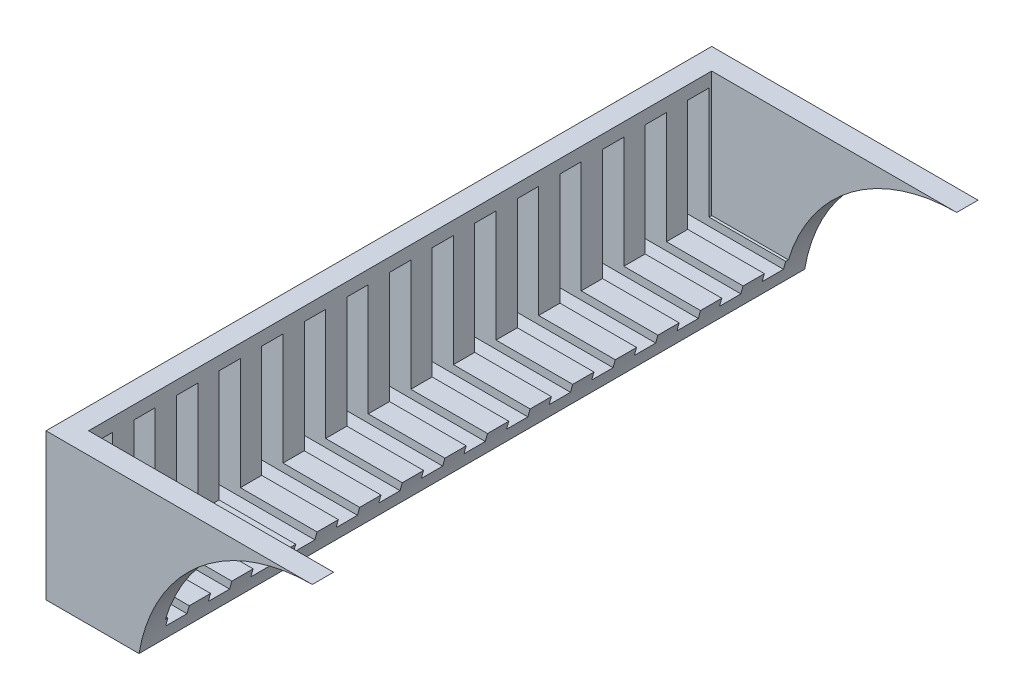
ISO-10303-21;
HEADER;
FILE_DESCRIPTION(('STEP AP214'),'2;1');
FILE_NAME('part.step','',(''),(''),'','','');
FILE_SCHEMA(('AUTOMOTIVE_DESIGN { 1 0 10303 214 1 1 1 1 }'));
ENDSEC;
DATA;
#1=APPLICATION_CONTEXT('core data for automotive mechanical design processes');
#2=APPLICATION_PROTOCOL_DEFINITION('international standard','automotive_design',2000,#1);
#3=PRODUCT_CONTEXT('',#1,'mechanical');
#4=PRODUCT('Part','Part','',(#3));
#5=PRODUCT_RELATED_PRODUCT_CATEGORY('part','',(#4));
#6=PRODUCT_DEFINITION_FORMATION('','',#4);
#7=PRODUCT_DEFINITION_CONTEXT('part definition',#1,'design');
#8=PRODUCT_DEFINITION('design','',#6,#7);
#9=PRODUCT_DEFINITION_SHAPE('','',#8);
#10=(LENGTH_UNIT() NAMED_UNIT(*) SI_UNIT(.MILLI.,.METRE.));
#11=(NAMED_UNIT(*) PLANE_ANGLE_UNIT() SI_UNIT($,.RADIAN.));
#12=(NAMED_UNIT(*) SI_UNIT($,.STERADIAN.) SOLID_ANGLE_UNIT());
#13=UNCERTAINTY_MEASURE_WITH_UNIT(LENGTH_MEASURE(1.E-05),#10,'distance_accuracy_value','');
#14=(GEOMETRIC_REPRESENTATION_CONTEXT(3) GLOBAL_UNCERTAINTY_ASSIGNED_CONTEXT((#13)) GLOBAL_UNIT_ASSIGNED_CONTEXT((#10,
#11,#12)) REPRESENTATION_CONTEXT('',''));
#15=CARTESIAN_POINT('',(0.,0.,0.));
#16=DIRECTION('',(0.,0.,1.));
#17=DIRECTION('',(1.,0.,0.));
#18=AXIS2_PLACEMENT_3D('',#15,#16,#17);
#19=CARTESIAN_POINT('',(0.,10.16,-317.5));
#20=DIRECTION('',(0.,-1.,0.));
#21=DIRECTION('',(0.,0.,-1.));
#22=AXIS2_PLACEMENT_3D('',#19,#20,#21);
#23=PLANE('',#22);
#24=DIRECTION('',(0.,0.,1.));
#25=VECTOR('',#24,1.);
#26=CARTESIAN_POINT('',(46.7283642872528,10.16,-317.5));
#27=LINE('',#26,#25);
#28=CARTESIAN_POINT('',(46.7283642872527,10.16,-10.16));
#29=VERTEX_POINT('',#28);
#30=CARTESIAN_POINT('',(46.7283642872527,10.16,-11.4299999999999));
#31=VERTEX_POINT('',#30);
#32=EDGE_CURVE('E1206',#29,#31,#27,.F.);
#33=ORIENTED_EDGE('',*,*,#32,.T.);
#34=DIRECTION('',(-1.,0.,0.));
#35=VECTOR('',#34,1.);
#36=CARTESIAN_POINT('',(0.,10.16,-11.4299999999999));
#37=LINE('',#36,#35);
#38=CARTESIAN_POINT('',(10.1600000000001,10.16,-11.4299999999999));
#39=VERTEX_POINT('',#38);
#40=EDGE_CURVE('E676',#31,#39,#37,.T.);
#41=ORIENTED_EDGE('',*,*,#40,.T.);
#42=DIRECTION('',(0.,0.,1.));
#43=VECTOR('',#42,1.);
#44=CARTESIAN_POINT('',(10.16,10.16,-307.34));
#45=LINE('',#44,#43);
#46=CARTESIAN_POINT('',(10.1600000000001,10.16,-10.1599999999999));
#47=VERTEX_POINT('',#46);
#48=EDGE_CURVE('E1234',#39,#47,#45,.T.);
#49=ORIENTED_EDGE('',*,*,#48,.T.);
#50=DIRECTION('',(1.,0.,0.));
#51=VECTOR('',#50,1.);
#52=CARTESIAN_POINT('',(10.1600000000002,10.16,-10.16));
#53=LINE('',#52,#51);
#54=EDGE_CURVE('E1225',#47,#29,#53,.T.);
#55=ORIENTED_EDGE('',*,*,#54,.T.);
#56=EDGE_LOOP('',(#33,#41,#49,#55));
#57=FACE_BOUND('',#56,.T.);
#58=ADVANCED_FACE('F33',(#57),#23,.F.);
#59=CARTESIAN_POINT('',(10.1600000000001,10.16,-31.7499999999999));
#60=VERTEX_POINT('',#59);
#61=CARTESIAN_POINT('',(10.1600000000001,10.16,-21.5899999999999));
#62=VERTEX_POINT('',#61);
#63=EDGE_CURVE('E1486',#60,#62,#45,.T.);
#64=ORIENTED_EDGE('',*,*,#63,.T.);
#65=DIRECTION('',(1.,0.,0.));
#66=VECTOR('',#65,1.);
#67=CARTESIAN_POINT('',(0.,10.16,-21.5899999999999));
#68=LINE('',#67,#66);
#69=CARTESIAN_POINT('',(46.7283642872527,10.16,-21.5899999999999));
#70=VERTEX_POINT('',#69);
#71=EDGE_CURVE('E670',#62,#70,#68,.T.);
#72=ORIENTED_EDGE('',*,*,#71,.T.);
#73=CARTESIAN_POINT('',(46.7283642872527,10.16,-31.7499999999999));
#74=VERTEX_POINT('',#73);
#75=EDGE_CURVE('E1210',#70,#74,#27,.F.);
#76=ORIENTED_EDGE('',*,*,#75,.T.);
#77=DIRECTION('',(-1.,0.,0.));
#78=VECTOR('',#77,1.);
#79=CARTESIAN_POINT('',(0.,10.16,-31.7499999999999));
#80=LINE('',#79,#78);
#81=EDGE_CURVE('E713',#74,#60,#80,.T.);
#82=ORIENTED_EDGE('',*,*,#81,.T.);
#83=EDGE_LOOP('',(#64,#72,#76,#82));
#84=FACE_BOUND('',#83,.T.);
#85=ADVANCED_FACE('F1461',(#84),#23,.F.);
#86=CARTESIAN_POINT('',(10.1600000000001,10.16,-52.07));
#87=VERTEX_POINT('',#86);
#88=CARTESIAN_POINT('',(10.1600000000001,10.16,-41.9099999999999));
#89=VERTEX_POINT('',#88);
#90=EDGE_CURVE('E1483',#87,#89,#45,.T.);
#91=ORIENTED_EDGE('',*,*,#90,.T.);
#92=DIRECTION('',(1.,0.,0.));
#93=VECTOR('',#92,1.);
#94=CARTESIAN_POINT('',(0.,10.16,-41.9099999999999));
#95=LINE('',#94,#93);
#96=CARTESIAN_POINT('',(46.7283642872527,10.16,-41.9099999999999));
#97=VERTEX_POINT('',#96);
#98=EDGE_CURVE('E707',#89,#97,#95,.T.);
#99=ORIENTED_EDGE('',*,*,#98,.T.);
#100=CARTESIAN_POINT('',(46.7283642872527,10.16,-52.07));
#101=VERTEX_POINT('',#100);
#102=EDGE_CURVE('E1450',#97,#101,#27,.F.);
#103=ORIENTED_EDGE('',*,*,#102,.T.);
#104=DIRECTION('',(-1.,0.,0.));
#105=VECTOR('',#104,1.);
#106=CARTESIAN_POINT('',(0.,10.16,-52.07));
#107=LINE('',#106,#105);
#108=EDGE_CURVE('E750',#101,#87,#107,.T.);
#109=ORIENTED_EDGE('',*,*,#108,.T.);
#110=EDGE_LOOP('',(#91,#99,#103,#109));
#111=FACE_BOUND('',#110,.T.);
#112=ADVANCED_FACE('F1484',(#111),#23,.F.);
#113=CARTESIAN_POINT('',(10.1600000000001,10.16,-72.39));
#114=VERTEX_POINT('',#113);
#115=CARTESIAN_POINT('',(10.1600000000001,10.16,-62.23));
#116=VERTEX_POINT('',#115);
#117=EDGE_CURVE('E1485',#114,#116,#45,.T.);
#118=ORIENTED_EDGE('',*,*,#117,.T.);
#119=DIRECTION('',(1.,0.,0.));
#120=VECTOR('',#119,1.);
#121=CARTESIAN_POINT('',(0.,10.16,-62.23));
#122=LINE('',#121,#120);
#123=CARTESIAN_POINT('',(46.7283642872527,10.16,-62.23));
#124=VERTEX_POINT('',#123);
#125=EDGE_CURVE('E744',#116,#124,#122,.T.);
#126=ORIENTED_EDGE('',*,*,#125,.T.);
#127=CARTESIAN_POINT('',(46.7283642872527,10.16,-72.39));
#128=VERTEX_POINT('',#127);
#129=EDGE_CURVE('E1446',#124,#128,#27,.F.);
#130=ORIENTED_EDGE('',*,*,#129,.T.);
#131=DIRECTION('',(-1.,0.,0.));
#132=VECTOR('',#131,1.);
#133=CARTESIAN_POINT('',(0.,10.16,-72.39));
#134=LINE('',#133,#132);
#135=EDGE_CURVE('E787',#128,#114,#134,.T.);
#136=ORIENTED_EDGE('',*,*,#135,.T.);
#137=EDGE_LOOP('',(#118,#126,#130,#136));
#138=FACE_BOUND('',#137,.T.);
#139=ADVANCED_FACE('F2265',(#138),#23,.F.);
#140=CARTESIAN_POINT('',(10.1600000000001,10.16,-92.71));
#141=VERTEX_POINT('',#140);
#142=CARTESIAN_POINT('',(10.1600000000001,10.16,-82.55));
#143=VERTEX_POINT('',#142);
#144=EDGE_CURVE('E1488',#141,#143,#45,.T.);
#145=ORIENTED_EDGE('',*,*,#144,.T.);
#146=DIRECTION('',(1.,0.,0.));
#147=VECTOR('',#146,1.);
#148=CARTESIAN_POINT('',(0.,10.16,-82.55));
#149=LINE('',#148,#147);
#150=CARTESIAN_POINT('',(46.7283642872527,10.16,-82.55));
#151=VERTEX_POINT('',#150);
#152=EDGE_CURVE('E781',#143,#151,#149,.T.);
#153=ORIENTED_EDGE('',*,*,#152,.T.);
#154=CARTESIAN_POINT('',(46.7283642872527,10.16,-92.71));
#155=VERTEX_POINT('',#154);
#156=EDGE_CURVE('E1442',#151,#155,#27,.F.);
#157=ORIENTED_EDGE('',*,*,#156,.T.);
#158=DIRECTION('',(-1.,0.,0.));
#159=VECTOR('',#158,1.);
#160=CARTESIAN_POINT('',(0.,10.16,-92.71));
#161=LINE('',#160,#159);
#162=EDGE_CURVE('E824',#155,#141,#161,.T.);
#163=ORIENTED_EDGE('',*,*,#162,.T.);
#164=EDGE_LOOP('',(#145,#153,#157,#163));
#165=FACE_BOUND('',#164,.T.);
#166=ADVANCED_FACE('F1554',(#165),#23,.F.);
#167=CARTESIAN_POINT('',(10.1600000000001,10.16,-113.03));
#168=VERTEX_POINT('',#167);
#169=CARTESIAN_POINT('',(10.1600000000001,10.16,-102.87));
#170=VERTEX_POINT('',#169);
#171=EDGE_CURVE('E1548',#168,#170,#45,.T.);
#172=ORIENTED_EDGE('',*,*,#171,.T.);
#173=DIRECTION('',(1.,0.,0.));
#174=VECTOR('',#173,1.);
#175=CARTESIAN_POINT('',(0.,10.16,-102.87));
#176=LINE('',#175,#174);
#177=CARTESIAN_POINT('',(46.7283642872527,10.16,-102.87));
#178=VERTEX_POINT('',#177);
#179=EDGE_CURVE('E818',#170,#178,#176,.T.);
#180=ORIENTED_EDGE('',*,*,#179,.T.);
#181=CARTESIAN_POINT('',(46.7283642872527,10.16,-113.03));
#182=VERTEX_POINT('',#181);
#183=EDGE_CURVE('E1438',#178,#182,#27,.F.);
#184=ORIENTED_EDGE('',*,*,#183,.T.);
#185=DIRECTION('',(-1.,0.,0.));
#186=VECTOR('',#185,1.);
#187=CARTESIAN_POINT('',(0.,10.16,-113.03));
#188=LINE('',#187,#186);
#189=EDGE_CURVE('E861',#182,#168,#188,.T.);
#190=ORIENTED_EDGE('',*,*,#189,.T.);
#191=EDGE_LOOP('',(#172,#180,#184,#190));
#192=FACE_BOUND('',#191,.T.);
#193=ADVANCED_FACE('F1590',(#192),#23,.F.);
#194=CARTESIAN_POINT('',(10.1600000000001,10.16,-133.35));
#195=VERTEX_POINT('',#194);
#196=CARTESIAN_POINT('',(10.1600000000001,10.16,-123.19));
#197=VERTEX_POINT('',#196);
#198=EDGE_CURVE('E1545',#195,#197,#45,.T.);
#199=ORIENTED_EDGE('',*,*,#198,.T.);
#200=DIRECTION('',(1.,0.,0.));
#201=VECTOR('',#200,1.);
#202=CARTESIAN_POINT('',(0.,10.16,-123.19));
#203=LINE('',#202,#201);
#204=CARTESIAN_POINT('',(46.7283642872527,10.16,-123.19));
#205=VERTEX_POINT('',#204);
#206=EDGE_CURVE('E855',#197,#205,#203,.T.);
#207=ORIENTED_EDGE('',*,*,#206,.T.);
#208=CARTESIAN_POINT('',(46.7283642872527,10.16,-133.35));
#209=VERTEX_POINT('',#208);
#210=EDGE_CURVE('E1434',#205,#209,#27,.F.);
#211=ORIENTED_EDGE('',*,*,#210,.T.);
#212=DIRECTION('',(-1.,0.,0.));
#213=VECTOR('',#212,1.);
#214=CARTESIAN_POINT('',(0.,10.16,-133.35));
#215=LINE('',#214,#213);
#216=EDGE_CURVE('E898',#209,#195,#215,.T.);
#217=ORIENTED_EDGE('',*,*,#216,.T.);
#218=EDGE_LOOP('',(#199,#207,#211,#217));
#219=FACE_BOUND('',#218,.T.);
#220=ADVANCED_FACE('F1609',(#219),#23,.F.);
#221=CARTESIAN_POINT('',(10.16,10.16,-153.67));
#222=VERTEX_POINT('',#221);
#223=CARTESIAN_POINT('',(10.1600000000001,10.16,-143.51));
#224=VERTEX_POINT('',#223);
#225=EDGE_CURVE('E1542',#222,#224,#45,.T.);
#226=ORIENTED_EDGE('',*,*,#225,.T.);
#227=DIRECTION('',(1.,0.,0.));
#228=VECTOR('',#227,1.);
#229=CARTESIAN_POINT('',(0.,10.16,-143.51));
#230=LINE('',#229,#228);
#231=CARTESIAN_POINT('',(46.7283642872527,10.16,-143.51));
#232=VERTEX_POINT('',#231);
#233=EDGE_CURVE('E892',#224,#232,#230,.T.);
#234=ORIENTED_EDGE('',*,*,#233,.T.);
#235=CARTESIAN_POINT('',(46.7283642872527,10.16,-153.67));
#236=VERTEX_POINT('',#235);
#237=EDGE_CURVE('E1430',#232,#236,#27,.F.);
#238=ORIENTED_EDGE('',*,*,#237,.T.);
#239=DIRECTION('',(-1.,0.,0.));
#240=VECTOR('',#239,1.);
#241=CARTESIAN_POINT('',(0.,10.16,-153.67));
#242=LINE('',#241,#240);
#243=EDGE_CURVE('E935',#236,#222,#242,.T.);
#244=ORIENTED_EDGE('',*,*,#243,.T.);
#245=EDGE_LOOP('',(#226,#234,#238,#244));
#246=FACE_BOUND('',#245,.T.);
#247=ADVANCED_FACE('F1628',(#246),#23,.F.);
#248=CARTESIAN_POINT('',(10.16,10.16,-173.99));
#249=VERTEX_POINT('',#248);
#250=CARTESIAN_POINT('',(10.16,10.16,-163.83));
#251=VERTEX_POINT('',#250);
#252=EDGE_CURVE('E1539',#249,#251,#45,.T.);
#253=ORIENTED_EDGE('',*,*,#252,.T.);
#254=DIRECTION('',(1.,0.,0.));
#255=VECTOR('',#254,1.);
#256=CARTESIAN_POINT('',(0.,10.16,-163.83));
#257=LINE('',#256,#255);
#258=CARTESIAN_POINT('',(46.7283642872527,10.16,-163.83));
#259=VERTEX_POINT('',#258);
#260=EDGE_CURVE('E929',#251,#259,#257,.T.);
#261=ORIENTED_EDGE('',*,*,#260,.T.);
#262=CARTESIAN_POINT('',(46.7283642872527,10.16,-173.99));
#263=VERTEX_POINT('',#262);
#264=EDGE_CURVE('E1426',#259,#263,#27,.F.);
#265=ORIENTED_EDGE('',*,*,#264,.T.);
#266=DIRECTION('',(-1.,0.,0.));
#267=VECTOR('',#266,1.);
#268=CARTESIAN_POINT('',(0.,10.16,-173.99));
#269=LINE('',#268,#267);
#270=EDGE_CURVE('E972',#263,#249,#269,.T.);
#271=ORIENTED_EDGE('',*,*,#270,.T.);
#272=EDGE_LOOP('',(#253,#261,#265,#271));
#273=FACE_BOUND('',#272,.T.);
#274=ADVANCED_FACE('F1647',(#273),#23,.F.);
#275=CARTESIAN_POINT('',(10.16,10.16,-194.31));
#276=VERTEX_POINT('',#275);
#277=CARTESIAN_POINT('',(10.16,10.16,-184.15));
#278=VERTEX_POINT('',#277);
#279=EDGE_CURVE('E1536',#276,#278,#45,.T.);
#280=ORIENTED_EDGE('',*,*,#279,.T.);
#281=DIRECTION('',(1.,0.,0.));
#282=VECTOR('',#281,1.);
#283=CARTESIAN_POINT('',(0.,10.16,-184.15));
#284=LINE('',#283,#282);
#285=CARTESIAN_POINT('',(46.7283642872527,10.16,-184.15));
#286=VERTEX_POINT('',#285);
#287=EDGE_CURVE('E966',#278,#286,#284,.T.);
#288=ORIENTED_EDGE('',*,*,#287,.T.);
#289=CARTESIAN_POINT('',(46.7283642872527,10.16,-194.31));
#290=VERTEX_POINT('',#289);
#291=EDGE_CURVE('E1422',#286,#290,#27,.F.);
#292=ORIENTED_EDGE('',*,*,#291,.T.);
#293=DIRECTION('',(-1.,0.,0.));
#294=VECTOR('',#293,1.);
#295=CARTESIAN_POINT('',(0.,10.16,-194.31));
#296=LINE('',#295,#294);
#297=EDGE_CURVE('E1009',#290,#276,#296,.T.);
#298=ORIENTED_EDGE('',*,*,#297,.T.);
#299=EDGE_LOOP('',(#280,#288,#292,#298));
#300=FACE_BOUND('',#299,.T.);
#301=ADVANCED_FACE('F1666',(#300),#23,.F.);
#302=CARTESIAN_POINT('',(10.16,10.16,-214.63));
#303=VERTEX_POINT('',#302);
#304=CARTESIAN_POINT('',(10.16,10.16,-204.47));
#305=VERTEX_POINT('',#304);
#306=EDGE_CURVE('E1533',#303,#305,#45,.T.);
#307=ORIENTED_EDGE('',*,*,#306,.T.);
#308=DIRECTION('',(1.,0.,0.));
#309=VECTOR('',#308,1.);
#310=CARTESIAN_POINT('',(0.,10.16,-204.47));
#311=LINE('',#310,#309);
#312=CARTESIAN_POINT('',(46.7283642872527,10.16,-204.47));
#313=VERTEX_POINT('',#312);
#314=EDGE_CURVE('E1003',#305,#313,#311,.T.);
#315=ORIENTED_EDGE('',*,*,#314,.T.);
#316=CARTESIAN_POINT('',(46.7283642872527,10.16,-214.63));
#317=VERTEX_POINT('',#316);
#318=EDGE_CURVE('E1418',#313,#317,#27,.F.);
#319=ORIENTED_EDGE('',*,*,#318,.T.);
#320=DIRECTION('',(-1.,0.,0.));
#321=VECTOR('',#320,1.);
#322=CARTESIAN_POINT('',(0.,10.16,-214.63));
#323=LINE('',#322,#321);
#324=EDGE_CURVE('E1046',#317,#303,#323,.T.);
#325=ORIENTED_EDGE('',*,*,#324,.T.);
#326=EDGE_LOOP('',(#307,#315,#319,#325));
#327=FACE_BOUND('',#326,.T.);
#328=ADVANCED_FACE('F1685',(#327),#23,.F.);
#329=CARTESIAN_POINT('',(10.16,10.16,-234.95));
#330=VERTEX_POINT('',#329);
#331=CARTESIAN_POINT('',(10.16,10.16,-224.79));
#332=VERTEX_POINT('',#331);
#333=EDGE_CURVE('E1530',#330,#332,#45,.T.);
#334=ORIENTED_EDGE('',*,*,#333,.T.);
#335=DIRECTION('',(1.,0.,0.));
#336=VECTOR('',#335,1.);
#337=CARTESIAN_POINT('',(0.,10.16,-224.79));
#338=LINE('',#337,#336);
#339=CARTESIAN_POINT('',(46.7283642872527,10.16,-224.79));
#340=VERTEX_POINT('',#339);
#341=EDGE_CURVE('E1040',#332,#340,#338,.T.);
#342=ORIENTED_EDGE('',*,*,#341,.T.);
#343=CARTESIAN_POINT('',(46.7283642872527,10.16,-234.95));
#344=VERTEX_POINT('',#343);
#345=EDGE_CURVE('E1414',#340,#344,#27,.F.);
#346=ORIENTED_EDGE('',*,*,#345,.T.);
#347=DIRECTION('',(-1.,0.,0.));
#348=VECTOR('',#347,1.);
#349=CARTESIAN_POINT('',(0.,10.16,-234.95));
#350=LINE('',#349,#348);
#351=EDGE_CURVE('E1083',#344,#330,#350,.T.);
#352=ORIENTED_EDGE('',*,*,#351,.T.);
#353=EDGE_LOOP('',(#334,#342,#346,#352));
#354=FACE_BOUND('',#353,.T.);
#355=ADVANCED_FACE('F1704',(#354),#23,.F.);
#356=CARTESIAN_POINT('',(10.16,10.16,-255.27));
#357=VERTEX_POINT('',#356);
#358=CARTESIAN_POINT('',(10.16,10.16,-245.11));
#359=VERTEX_POINT('',#358);
#360=EDGE_CURVE('E1527',#357,#359,#45,.T.);
#361=ORIENTED_EDGE('',*,*,#360,.T.);
#362=DIRECTION('',(1.,0.,0.));
#363=VECTOR('',#362,1.);
#364=CARTESIAN_POINT('',(0.,10.16,-245.11));
#365=LINE('',#364,#363);
#366=CARTESIAN_POINT('',(46.7283642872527,10.16,-245.11));
#367=VERTEX_POINT('',#366);
#368=EDGE_CURVE('E1077',#359,#367,#365,.T.);
#369=ORIENTED_EDGE('',*,*,#368,.T.);
#370=CARTESIAN_POINT('',(46.7283642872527,10.16,-255.27));
#371=VERTEX_POINT('',#370);
#372=EDGE_CURVE('E1410',#367,#371,#27,.F.);
#373=ORIENTED_EDGE('',*,*,#372,.T.);
#374=DIRECTION('',(-1.,0.,0.));
#375=VECTOR('',#374,1.);
#376=CARTESIAN_POINT('',(0.,10.16,-255.27));
#377=LINE('',#376,#375);
#378=EDGE_CURVE('E1120',#371,#357,#377,.T.);
#379=ORIENTED_EDGE('',*,*,#378,.T.);
#380=EDGE_LOOP('',(#361,#369,#373,#379));
#381=FACE_BOUND('',#380,.T.);
#382=ADVANCED_FACE('F1522',(#381),#23,.F.);
#383=CARTESIAN_POINT('',(10.16,10.16,-275.59));
#384=VERTEX_POINT('',#383);
#385=CARTESIAN_POINT('',(10.16,10.16,-265.43));
#386=VERTEX_POINT('',#385);
#387=EDGE_CURVE('E1525',#384,#386,#45,.T.);
#388=ORIENTED_EDGE('',*,*,#387,.T.);
#389=DIRECTION('',(1.,0.,0.));
#390=VECTOR('',#389,1.);
#391=CARTESIAN_POINT('',(0.,10.16,-265.43));
#392=LINE('',#391,#390);
#393=CARTESIAN_POINT('',(46.7283642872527,10.16,-265.43));
#394=VERTEX_POINT('',#393);
#395=EDGE_CURVE('E1114',#386,#394,#392,.T.);
#396=ORIENTED_EDGE('',*,*,#395,.T.);
#397=CARTESIAN_POINT('',(46.7283642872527,10.16,-275.59));
#398=VERTEX_POINT('',#397);
#399=EDGE_CURVE('E1406',#394,#398,#27,.F.);
#400=ORIENTED_EDGE('',*,*,#399,.T.);
#401=DIRECTION('',(-1.,0.,0.));
#402=VECTOR('',#401,1.);
#403=CARTESIAN_POINT('',(0.,10.16,-275.59));
#404=LINE('',#403,#402);
#405=EDGE_CURVE('E1157',#398,#384,#404,.T.);
#406=ORIENTED_EDGE('',*,*,#405,.T.);
#407=EDGE_LOOP('',(#388,#396,#400,#406));
#408=FACE_BOUND('',#407,.T.);
#409=ADVANCED_FACE('F1517',(#408),#23,.F.);
#410=CARTESIAN_POINT('',(10.16,10.16,-295.91));
#411=VERTEX_POINT('',#410);
#412=CARTESIAN_POINT('',(10.16,10.16,-285.75));
#413=VERTEX_POINT('',#412);
#414=EDGE_CURVE('E1233',#411,#413,#45,.T.);
#415=ORIENTED_EDGE('',*,*,#414,.T.);
#416=DIRECTION('',(1.,0.,0.));
#417=VECTOR('',#416,1.);
#418=CARTESIAN_POINT('',(0.,10.16,-285.75));
#419=LINE('',#418,#417);
#420=CARTESIAN_POINT('',(46.7283642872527,10.16,-285.75));
#421=VERTEX_POINT('',#420);
#422=EDGE_CURVE('E1151',#413,#421,#419,.T.);
#423=ORIENTED_EDGE('',*,*,#422,.T.);
#424=CARTESIAN_POINT('',(46.7283642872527,10.16,-295.91));
#425=VERTEX_POINT('',#424);
#426=EDGE_CURVE('E1405',#421,#425,#27,.F.);
#427=ORIENTED_EDGE('',*,*,#426,.T.);
#428=DIRECTION('',(-1.,0.,0.));
#429=VECTOR('',#428,1.);
#430=CARTESIAN_POINT('',(0.,10.16,-295.91));
#431=LINE('',#430,#429);
#432=EDGE_CURVE('E1194',#425,#411,#431,.T.);
#433=ORIENTED_EDGE('',*,*,#432,.T.);
#434=EDGE_LOOP('',(#415,#423,#427,#433));
#435=FACE_BOUND('',#434,.T.);
#436=ADVANCED_FACE('F1510',(#435),#23,.F.);
#437=CARTESIAN_POINT('',(0.,69.85,-317.5));
#438=DIRECTION('',(-1.,0.,0.));
#439=DIRECTION('',(0.,-1.,0.));
#440=AXIS2_PLACEMENT_3D('',#437,#438,#439);
#441=PLANE('',#440);
#442=DIRECTION('',(0.,0.,-1.));
#443=VECTOR('',#442,1.);
#444=CARTESIAN_POINT('',(0.,63.5,-21.5899999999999));
#445=LINE('',#444,#443);
#446=CARTESIAN_POINT('',(0.,63.5,-11.4299999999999));
#447=VERTEX_POINT('',#446);
#448=CARTESIAN_POINT('',(0.,63.5,-21.5899999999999));
#449=VERTEX_POINT('',#448);
#450=EDGE_CURVE('E48',#447,#449,#445,.T.);
#451=ORIENTED_EDGE('',*,*,#450,.F.);
#452=DIRECTION('',(0.,1.,0.));
#453=VECTOR('',#452,1.);
#454=CARTESIAN_POINT('',(0.,63.5,-11.4299999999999));
#455=LINE('',#454,#453);
#456=CARTESIAN_POINT('',(0.,6.35,-11.4299999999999));
#457=VERTEX_POINT('',#456);
#458=EDGE_CURVE('E656',#457,#447,#455,.T.);
#459=ORIENTED_EDGE('',*,*,#458,.F.);
#460=DIRECTION('',(0.,0.,1.));
#461=VECTOR('',#460,1.);
#462=CARTESIAN_POINT('',(0.,6.35,-11.4299999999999));
#463=LINE('',#462,#461);
#464=CARTESIAN_POINT('',(0.,6.35,-21.5899999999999));
#465=VERTEX_POINT('',#464);
#466=EDGE_CURVE('E641',#465,#457,#463,.T.);
#467=ORIENTED_EDGE('',*,*,#466,.F.);
#468=DIRECTION('',(0.,-1.,0.));
#469=VECTOR('',#468,1.);
#470=CARTESIAN_POINT('',(0.,63.5,-21.5899999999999));
#471=LINE('',#470,#469);
#472=EDGE_CURVE('E650',#449,#465,#471,.T.);
#473=ORIENTED_EDGE('',*,*,#472,.F.);
#474=EDGE_LOOP('',(#451,#459,#467,#473));
#475=FACE_BOUND('',#474,.T.);
#476=DIRECTION('',(0.,0.,-1.));
#477=VECTOR('',#476,1.);
#478=CARTESIAN_POINT('',(0.,63.5,-41.9099999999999));
#479=LINE('',#478,#477);
#480=CARTESIAN_POINT('',(0.,63.5,-31.7499999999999));
#481=VERTEX_POINT('',#480);
#482=CARTESIAN_POINT('',(0.,63.5,-41.9099999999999));
#483=VERTEX_POINT('',#482);
#484=EDGE_CURVE('E679',#481,#483,#479,.T.);
#485=ORIENTED_EDGE('',*,*,#484,.F.);
#486=DIRECTION('',(0.,1.,0.));
#487=VECTOR('',#486,1.);
#488=CARTESIAN_POINT('',(0.,63.5,-31.7499999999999));
#489=LINE('',#488,#487);
#490=CARTESIAN_POINT('',(0.,6.35,-31.7499999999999));
#491=VERTEX_POINT('',#490);
#492=EDGE_CURVE('E692',#491,#481,#489,.T.);
#493=ORIENTED_EDGE('',*,*,#492,.F.);
#494=DIRECTION('',(0.,0.,1.));
#495=VECTOR('',#494,1.);
#496=CARTESIAN_POINT('',(0.,6.35,-31.7499999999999));
#497=LINE('',#496,#495);
#498=CARTESIAN_POINT('',(0.,6.35,-41.9099999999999));
#499=VERTEX_POINT('',#498);
#500=EDGE_CURVE('E689',#499,#491,#497,.T.);
#501=ORIENTED_EDGE('',*,*,#500,.F.);
#502=DIRECTION('',(0.,-1.,0.));
#503=VECTOR('',#502,1.);
#504=CARTESIAN_POINT('',(0.,63.5,-41.9099999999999));
#505=LINE('',#504,#503);
#506=EDGE_CURVE('E686',#483,#499,#505,.T.);
#507=ORIENTED_EDGE('',*,*,#506,.F.);
#508=EDGE_LOOP('',(#485,#493,#501,#507));
#509=FACE_BOUND('',#508,.T.);
#510=DIRECTION('',(0.,0.,-1.));
#511=VECTOR('',#510,1.);
#512=CARTESIAN_POINT('',(0.,63.5,-62.23));
#513=LINE('',#512,#511);
#514=CARTESIAN_POINT('',(0.,63.5,-52.07));
#515=VERTEX_POINT('',#514);
#516=CARTESIAN_POINT('',(0.,63.5,-62.23));
#517=VERTEX_POINT('',#516);
#518=EDGE_CURVE('E716',#515,#517,#513,.T.);
#519=ORIENTED_EDGE('',*,*,#518,.F.);
#520=DIRECTION('',(0.,1.,0.));
#521=VECTOR('',#520,1.);
#522=CARTESIAN_POINT('',(0.,63.5,-52.07));
#523=LINE('',#522,#521);
#524=CARTESIAN_POINT('',(0.,6.35,-52.07));
#525=VERTEX_POINT('',#524);
#526=EDGE_CURVE('E729',#525,#515,#523,.T.);
#527=ORIENTED_EDGE('',*,*,#526,.F.);
#528=DIRECTION('',(0.,0.,1.));
#529=VECTOR('',#528,1.);
#530=CARTESIAN_POINT('',(0.,6.35,-52.07));
#531=LINE('',#530,#529);
#532=CARTESIAN_POINT('',(0.,6.35,-62.23));
#533=VERTEX_POINT('',#532);
#534=EDGE_CURVE('E726',#533,#525,#531,.T.);
#535=ORIENTED_EDGE('',*,*,#534,.F.);
#536=DIRECTION('',(0.,-1.,0.));
#537=VECTOR('',#536,1.);
#538=CARTESIAN_POINT('',(0.,63.5,-62.23));
#539=LINE('',#538,#537);
#540=EDGE_CURVE('E723',#517,#533,#539,.T.);
#541=ORIENTED_EDGE('',*,*,#540,.F.);
#542=EDGE_LOOP('',(#519,#527,#535,#541));
#543=FACE_BOUND('',#542,.T.);
#544=DIRECTION('',(0.,0.,-1.));
#545=VECTOR('',#544,1.);
#546=CARTESIAN_POINT('',(0.,63.5,-82.55));
#547=LINE('',#546,#545);
#548=CARTESIAN_POINT('',(0.,63.5,-72.39));
#549=VERTEX_POINT('',#548);
#550=CARTESIAN_POINT('',(0.,63.5,-82.55));
#551=VERTEX_POINT('',#550);
#552=EDGE_CURVE('E753',#549,#551,#547,.T.);
#553=ORIENTED_EDGE('',*,*,#552,.F.);
#554=DIRECTION('',(0.,1.,0.));
#555=VECTOR('',#554,1.);
#556=CARTESIAN_POINT('',(0.,63.5,-72.39));
#557=LINE('',#556,#555);
#558=CARTESIAN_POINT('',(0.,6.35,-72.39));
#559=VERTEX_POINT('',#558);
#560=EDGE_CURVE('E766',#559,#549,#557,.T.);
#561=ORIENTED_EDGE('',*,*,#560,.F.);
#562=DIRECTION('',(0.,0.,1.));
#563=VECTOR('',#562,1.);
#564=CARTESIAN_POINT('',(0.,6.35,-72.39));
#565=LINE('',#564,#563);
#566=CARTESIAN_POINT('',(0.,6.35,-82.55));
#567=VERTEX_POINT('',#566);
#568=EDGE_CURVE('E763',#567,#559,#565,.T.);
#569=ORIENTED_EDGE('',*,*,#568,.F.);
#570=DIRECTION('',(0.,-1.,0.));
#571=VECTOR('',#570,1.);
#572=CARTESIAN_POINT('',(0.,63.5,-82.55));
#573=LINE('',#572,#571);
#574=EDGE_CURVE('E760',#551,#567,#573,.T.);
#575=ORIENTED_EDGE('',*,*,#574,.F.);
#576=EDGE_LOOP('',(#553,#561,#569,#575));
#577=FACE_BOUND('',#576,.T.);
#578=DIRECTION('',(0.,0.,-1.));
#579=VECTOR('',#578,1.);
#580=CARTESIAN_POINT('',(0.,63.5,-102.87));
#581=LINE('',#580,#579);
#582=CARTESIAN_POINT('',(0.,63.5,-92.71));
#583=VERTEX_POINT('',#582);
#584=CARTESIAN_POINT('',(0.,63.5,-102.87));
#585=VERTEX_POINT('',#584);
#586=EDGE_CURVE('E790',#583,#585,#581,.T.);
#587=ORIENTED_EDGE('',*,*,#586,.F.);
#588=DIRECTION('',(0.,1.,0.));
#589=VECTOR('',#588,1.);
#590=CARTESIAN_POINT('',(0.,63.5,-92.71));
#591=LINE('',#590,#589);
#592=CARTESIAN_POINT('',(0.,6.35,-92.71));
#593=VERTEX_POINT('',#592);
#594=EDGE_CURVE('E803',#593,#583,#591,.T.);
#595=ORIENTED_EDGE('',*,*,#594,.F.);
#596=DIRECTION('',(0.,0.,1.));
#597=VECTOR('',#596,1.);
#598=CARTESIAN_POINT('',(0.,6.35,-92.71));
#599=LINE('',#598,#597);
#600=CARTESIAN_POINT('',(0.,6.35,-102.87));
#601=VERTEX_POINT('',#600);
#602=EDGE_CURVE('E800',#601,#593,#599,.T.);
#603=ORIENTED_EDGE('',*,*,#602,.F.);
#604=DIRECTION('',(0.,-1.,0.));
#605=VECTOR('',#604,1.);
#606=CARTESIAN_POINT('',(0.,63.5,-102.87));
#607=LINE('',#606,#605);
#608=EDGE_CURVE('E797',#585,#601,#607,.T.);
#609=ORIENTED_EDGE('',*,*,#608,.F.);
#610=EDGE_LOOP('',(#587,#595,#603,#609));
#611=FACE_BOUND('',#610,.T.);
#612=DIRECTION('',(0.,0.,-1.));
#613=VECTOR('',#612,1.);
#614=CARTESIAN_POINT('',(0.,63.5,-123.19));
#615=LINE('',#614,#613);
#616=CARTESIAN_POINT('',(0.,63.5,-113.03));
#617=VERTEX_POINT('',#616);
#618=CARTESIAN_POINT('',(0.,63.5,-123.19));
#619=VERTEX_POINT('',#618);
#620=EDGE_CURVE('E827',#617,#619,#615,.T.);
#621=ORIENTED_EDGE('',*,*,#620,.F.);
#622=DIRECTION('',(0.,1.,0.));
#623=VECTOR('',#622,1.);
#624=CARTESIAN_POINT('',(0.,63.5,-113.03));
#625=LINE('',#624,#623);
#626=CARTESIAN_POINT('',(0.,6.35,-113.03));
#627=VERTEX_POINT('',#626);
#628=EDGE_CURVE('E840',#627,#617,#625,.T.);
#629=ORIENTED_EDGE('',*,*,#628,.F.);
#630=DIRECTION('',(0.,0.,1.));
#631=VECTOR('',#630,1.);
#632=CARTESIAN_POINT('',(0.,6.35,-113.03));
#633=LINE('',#632,#631);
#634=CARTESIAN_POINT('',(0.,6.35,-123.19));
#635=VERTEX_POINT('',#634);
#636=EDGE_CURVE('E837',#635,#627,#633,.T.);
#637=ORIENTED_EDGE('',*,*,#636,.F.);
#638=DIRECTION('',(0.,-1.,0.));
#639=VECTOR('',#638,1.);
#640=CARTESIAN_POINT('',(0.,63.5,-123.19));
#641=LINE('',#640,#639);
#642=EDGE_CURVE('E834',#619,#635,#641,.T.);
#643=ORIENTED_EDGE('',*,*,#642,.F.);
#644=EDGE_LOOP('',(#621,#629,#637,#643));
#645=FACE_BOUND('',#644,.T.);
#646=DIRECTION('',(0.,0.,-1.));
#647=VECTOR('',#646,1.);
#648=CARTESIAN_POINT('',(0.,63.5,-143.51));
#649=LINE('',#648,#647);
#650=CARTESIAN_POINT('',(0.,63.5,-133.35));
#651=VERTEX_POINT('',#650);
#652=CARTESIAN_POINT('',(0.,63.5,-143.51));
#653=VERTEX_POINT('',#652);
#654=EDGE_CURVE('E864',#651,#653,#649,.T.);
#655=ORIENTED_EDGE('',*,*,#654,.F.);
#656=DIRECTION('',(0.,1.,0.));
#657=VECTOR('',#656,1.);
#658=CARTESIAN_POINT('',(0.,63.5,-133.35));
#659=LINE('',#658,#657);
#660=CARTESIAN_POINT('',(0.,6.35,-133.35));
#661=VERTEX_POINT('',#660);
#662=EDGE_CURVE('E877',#661,#651,#659,.T.);
#663=ORIENTED_EDGE('',*,*,#662,.F.);
#664=DIRECTION('',(0.,0.,1.));
#665=VECTOR('',#664,1.);
#666=CARTESIAN_POINT('',(0.,6.35,-133.35));
#667=LINE('',#666,#665);
#668=CARTESIAN_POINT('',(0.,6.35,-143.51));
#669=VERTEX_POINT('',#668);
#670=EDGE_CURVE('E874',#669,#661,#667,.T.);
#671=ORIENTED_EDGE('',*,*,#670,.F.);
#672=DIRECTION('',(0.,-1.,0.));
#673=VECTOR('',#672,1.);
#674=CARTESIAN_POINT('',(0.,63.5,-143.51));
#675=LINE('',#674,#673);
#676=EDGE_CURVE('E871',#653,#669,#675,.T.);
#677=ORIENTED_EDGE('',*,*,#676,.F.);
#678=EDGE_LOOP('',(#655,#663,#671,#677));
#679=FACE_BOUND('',#678,.T.);
#680=DIRECTION('',(0.,0.,-1.));
#681=VECTOR('',#680,1.);
#682=CARTESIAN_POINT('',(0.,63.5,-163.83));
#683=LINE('',#682,#681);
#684=CARTESIAN_POINT('',(0.,63.5,-153.67));
#685=VERTEX_POINT('',#684);
#686=CARTESIAN_POINT('',(0.,63.5,-163.83));
#687=VERTEX_POINT('',#686);
#688=EDGE_CURVE('E901',#685,#687,#683,.T.);
#689=ORIENTED_EDGE('',*,*,#688,.F.);
#690=DIRECTION('',(0.,1.,0.));
#691=VECTOR('',#690,1.);
#692=CARTESIAN_POINT('',(0.,63.5,-153.67));
#693=LINE('',#692,#691);
#694=CARTESIAN_POINT('',(0.,6.35,-153.67));
#695=VERTEX_POINT('',#694);
#696=EDGE_CURVE('E914',#695,#685,#693,.T.);
#697=ORIENTED_EDGE('',*,*,#696,.F.);
#698=DIRECTION('',(0.,0.,1.));
#699=VECTOR('',#698,1.);
#700=CARTESIAN_POINT('',(0.,6.35,-153.67));
#701=LINE('',#700,#699);
#702=CARTESIAN_POINT('',(0.,6.35,-163.83));
#703=VERTEX_POINT('',#702);
#704=EDGE_CURVE('E911',#703,#695,#701,.T.);
#705=ORIENTED_EDGE('',*,*,#704,.F.);
#706=DIRECTION('',(0.,-1.,0.));
#707=VECTOR('',#706,1.);
#708=CARTESIAN_POINT('',(0.,63.5,-163.83));
#709=LINE('',#708,#707);
#710=EDGE_CURVE('E908',#687,#703,#709,.T.);
#711=ORIENTED_EDGE('',*,*,#710,.F.);
#712=EDGE_LOOP('',(#689,#697,#705,#711));
#713=FACE_BOUND('',#712,.T.);
#714=DIRECTION('',(0.,0.,-1.));
#715=VECTOR('',#714,1.);
#716=CARTESIAN_POINT('',(0.,63.5,-184.15));
#717=LINE('',#716,#715);
#718=CARTESIAN_POINT('',(0.,63.5,-173.99));
#719=VERTEX_POINT('',#718);
#720=CARTESIAN_POINT('',(0.,63.5,-184.15));
#721=VERTEX_POINT('',#720);
#722=EDGE_CURVE('E938',#719,#721,#717,.T.);
#723=ORIENTED_EDGE('',*,*,#722,.F.);
#724=DIRECTION('',(0.,1.,0.));
#725=VECTOR('',#724,1.);
#726=CARTESIAN_POINT('',(0.,63.5,-173.99));
#727=LINE('',#726,#725);
#728=CARTESIAN_POINT('',(0.,6.35,-173.99));
#729=VERTEX_POINT('',#728);
#730=EDGE_CURVE('E951',#729,#719,#727,.T.);
#731=ORIENTED_EDGE('',*,*,#730,.F.);
#732=DIRECTION('',(0.,0.,1.));
#733=VECTOR('',#732,1.);
#734=CARTESIAN_POINT('',(0.,6.35,-173.99));
#735=LINE('',#734,#733);
#736=CARTESIAN_POINT('',(0.,6.35,-184.15));
#737=VERTEX_POINT('',#736);
#738=EDGE_CURVE('E948',#737,#729,#735,.T.);
#739=ORIENTED_EDGE('',*,*,#738,.F.);
#740=DIRECTION('',(0.,-1.,0.));
#741=VECTOR('',#740,1.);
#742=CARTESIAN_POINT('',(0.,63.5,-184.15));
#743=LINE('',#742,#741);
#744=EDGE_CURVE('E945',#721,#737,#743,.T.);
#745=ORIENTED_EDGE('',*,*,#744,.F.);
#746=EDGE_LOOP('',(#723,#731,#739,#745));
#747=FACE_BOUND('',#746,.T.);
#748=DIRECTION('',(0.,0.,-1.));
#749=VECTOR('',#748,1.);
#750=CARTESIAN_POINT('',(0.,63.5,-204.47));
#751=LINE('',#750,#749);
#752=CARTESIAN_POINT('',(0.,63.5,-194.31));
#753=VERTEX_POINT('',#752);
#754=CARTESIAN_POINT('',(0.,63.5,-204.47));
#755=VERTEX_POINT('',#754);
#756=EDGE_CURVE('E975',#753,#755,#751,.T.);
#757=ORIENTED_EDGE('',*,*,#756,.F.);
#758=DIRECTION('',(0.,1.,0.));
#759=VECTOR('',#758,1.);
#760=CARTESIAN_POINT('',(0.,63.5,-194.31));
#761=LINE('',#760,#759);
#762=CARTESIAN_POINT('',(0.,6.35,-194.31));
#763=VERTEX_POINT('',#762);
#764=EDGE_CURVE('E988',#763,#753,#761,.T.);
#765=ORIENTED_EDGE('',*,*,#764,.F.);
#766=DIRECTION('',(0.,0.,1.));
#767=VECTOR('',#766,1.);
#768=CARTESIAN_POINT('',(0.,6.35,-194.31));
#769=LINE('',#768,#767);
#770=CARTESIAN_POINT('',(0.,6.35,-204.47));
#771=VERTEX_POINT('',#770);
#772=EDGE_CURVE('E985',#771,#763,#769,.T.);
#773=ORIENTED_EDGE('',*,*,#772,.F.);
#774=DIRECTION('',(0.,-1.,0.));
#775=VECTOR('',#774,1.);
#776=CARTESIAN_POINT('',(0.,63.5,-204.47));
#777=LINE('',#776,#775);
#778=EDGE_CURVE('E982',#755,#771,#777,.T.);
#779=ORIENTED_EDGE('',*,*,#778,.F.);
#780=EDGE_LOOP('',(#757,#765,#773,#779));
#781=FACE_BOUND('',#780,.T.);
#782=DIRECTION('',(0.,0.,-1.));
#783=VECTOR('',#782,1.);
#784=CARTESIAN_POINT('',(0.,63.5,-224.79));
#785=LINE('',#784,#783);
#786=CARTESIAN_POINT('',(0.,63.5,-214.63));
#787=VERTEX_POINT('',#786);
#788=CARTESIAN_POINT('',(0.,63.5,-224.79));
#789=VERTEX_POINT('',#788);
#790=EDGE_CURVE('E1012',#787,#789,#785,.T.);
#791=ORIENTED_EDGE('',*,*,#790,.F.);
#792=DIRECTION('',(0.,1.,0.));
#793=VECTOR('',#792,1.);
#794=CARTESIAN_POINT('',(0.,63.5,-214.63));
#795=LINE('',#794,#793);
#796=CARTESIAN_POINT('',(0.,6.35,-214.63));
#797=VERTEX_POINT('',#796);
#798=EDGE_CURVE('E1025',#797,#787,#795,.T.);
#799=ORIENTED_EDGE('',*,*,#798,.F.);
#800=DIRECTION('',(0.,0.,1.));
#801=VECTOR('',#800,1.);
#802=CARTESIAN_POINT('',(0.,6.35,-214.63));
#803=LINE('',#802,#801);
#804=CARTESIAN_POINT('',(0.,6.35,-224.79));
#805=VERTEX_POINT('',#804);
#806=EDGE_CURVE('E1022',#805,#797,#803,.T.);
#807=ORIENTED_EDGE('',*,*,#806,.F.);
#808=DIRECTION('',(0.,-1.,0.));
#809=VECTOR('',#808,1.);
#810=CARTESIAN_POINT('',(0.,63.5,-224.79));
#811=LINE('',#810,#809);
#812=EDGE_CURVE('E1019',#789,#805,#811,.T.);
#813=ORIENTED_EDGE('',*,*,#812,.F.);
#814=EDGE_LOOP('',(#791,#799,#807,#813));
#815=FACE_BOUND('',#814,.T.);
#816=DIRECTION('',(0.,0.,-1.));
#817=VECTOR('',#816,1.);
#818=CARTESIAN_POINT('',(0.,63.5,-245.11));
#819=LINE('',#818,#817);
#820=CARTESIAN_POINT('',(0.,63.5,-234.95));
#821=VERTEX_POINT('',#820);
#822=CARTESIAN_POINT('',(0.,63.5,-245.11));
#823=VERTEX_POINT('',#822);
#824=EDGE_CURVE('E1049',#821,#823,#819,.T.);
#825=ORIENTED_EDGE('',*,*,#824,.F.);
#826=DIRECTION('',(0.,1.,0.));
#827=VECTOR('',#826,1.);
#828=CARTESIAN_POINT('',(0.,63.5,-234.95));
#829=LINE('',#828,#827);
#830=CARTESIAN_POINT('',(0.,6.35,-234.95));
#831=VERTEX_POINT('',#830);
#832=EDGE_CURVE('E1062',#831,#821,#829,.T.);
#833=ORIENTED_EDGE('',*,*,#832,.F.);
#834=DIRECTION('',(0.,0.,1.));
#835=VECTOR('',#834,1.);
#836=CARTESIAN_POINT('',(0.,6.35,-234.95));
#837=LINE('',#836,#835);
#838=CARTESIAN_POINT('',(0.,6.35,-245.11));
#839=VERTEX_POINT('',#838);
#840=EDGE_CURVE('E1059',#839,#831,#837,.T.);
#841=ORIENTED_EDGE('',*,*,#840,.F.);
#842=DIRECTION('',(0.,-1.,0.));
#843=VECTOR('',#842,1.);
#844=CARTESIAN_POINT('',(0.,63.5,-245.11));
#845=LINE('',#844,#843);
#846=EDGE_CURVE('E1056',#823,#839,#845,.T.);
#847=ORIENTED_EDGE('',*,*,#846,.F.);
#848=EDGE_LOOP('',(#825,#833,#841,#847));
#849=FACE_BOUND('',#848,.T.);
#850=DIRECTION('',(0.,0.,-1.));
#851=VECTOR('',#850,1.);
#852=CARTESIAN_POINT('',(0.,63.5,-265.43));
#853=LINE('',#852,#851);
#854=CARTESIAN_POINT('',(0.,63.5,-255.27));
#855=VERTEX_POINT('',#854);
#856=CARTESIAN_POINT('',(0.,63.5,-265.43));
#857=VERTEX_POINT('',#856);
#858=EDGE_CURVE('E1086',#855,#857,#853,.T.);
#859=ORIENTED_EDGE('',*,*,#858,.F.);
#860=DIRECTION('',(0.,1.,0.));
#861=VECTOR('',#860,1.);
#862=CARTESIAN_POINT('',(0.,63.5,-255.27));
#863=LINE('',#862,#861);
#864=CARTESIAN_POINT('',(0.,6.35,-255.27));
#865=VERTEX_POINT('',#864);
#866=EDGE_CURVE('E1099',#865,#855,#863,.T.);
#867=ORIENTED_EDGE('',*,*,#866,.F.);
#868=DIRECTION('',(0.,0.,1.));
#869=VECTOR('',#868,1.);
#870=CARTESIAN_POINT('',(0.,6.35,-255.27));
#871=LINE('',#870,#869);
#872=CARTESIAN_POINT('',(0.,6.35,-265.43));
#873=VERTEX_POINT('',#872);
#874=EDGE_CURVE('E1096',#873,#865,#871,.T.);
#875=ORIENTED_EDGE('',*,*,#874,.F.);
#876=DIRECTION('',(0.,-1.,0.));
#877=VECTOR('',#876,1.);
#878=CARTESIAN_POINT('',(0.,63.5,-265.43));
#879=LINE('',#878,#877);
#880=EDGE_CURVE('E1093',#857,#873,#879,.T.);
#881=ORIENTED_EDGE('',*,*,#880,.F.);
#882=EDGE_LOOP('',(#859,#867,#875,#881));
#883=FACE_BOUND('',#882,.T.);
#884=DIRECTION('',(0.,0.,-1.));
#885=VECTOR('',#884,1.);
#886=CARTESIAN_POINT('',(0.,63.5,-285.75));
#887=LINE('',#886,#885);
#888=CARTESIAN_POINT('',(0.,63.5,-275.59));
#889=VERTEX_POINT('',#888);
#890=CARTESIAN_POINT('',(0.,63.5,-285.75));
#891=VERTEX_POINT('',#890);
#892=EDGE_CURVE('E1123',#889,#891,#887,.T.);
#893=ORIENTED_EDGE('',*,*,#892,.F.);
#894=DIRECTION('',(0.,1.,0.));
#895=VECTOR('',#894,1.);
#896=CARTESIAN_POINT('',(0.,63.5,-275.59));
#897=LINE('',#896,#895);
#898=CARTESIAN_POINT('',(0.,6.35,-275.59));
#899=VERTEX_POINT('',#898);
#900=EDGE_CURVE('E1136',#899,#889,#897,.T.);
#901=ORIENTED_EDGE('',*,*,#900,.F.);
#902=DIRECTION('',(0.,0.,1.));
#903=VECTOR('',#902,1.);
#904=CARTESIAN_POINT('',(0.,6.35,-275.59));
#905=LINE('',#904,#903);
#906=CARTESIAN_POINT('',(0.,6.35,-285.75));
#907=VERTEX_POINT('',#906);
#908=EDGE_CURVE('E1133',#907,#899,#905,.T.);
#909=ORIENTED_EDGE('',*,*,#908,.F.);
#910=DIRECTION('',(0.,-1.,0.));
#911=VECTOR('',#910,1.);
#912=CARTESIAN_POINT('',(0.,63.5,-285.75));
#913=LINE('',#912,#911);
#914=EDGE_CURVE('E1130',#891,#907,#913,.T.);
#915=ORIENTED_EDGE('',*,*,#914,.F.);
#916=EDGE_LOOP('',(#893,#901,#909,#915));
#917=FACE_BOUND('',#916,.T.);
#918=DIRECTION('',(0.,0.,-1.));
#919=VECTOR('',#918,1.);
#920=CARTESIAN_POINT('',(0.,63.5,-306.07));
#921=LINE('',#920,#919);
#922=CARTESIAN_POINT('',(0.,63.5,-295.91));
#923=VERTEX_POINT('',#922);
#924=CARTESIAN_POINT('',(0.,63.5,-306.07));
#925=VERTEX_POINT('',#924);
#926=EDGE_CURVE('E1160',#923,#925,#921,.T.);
#927=ORIENTED_EDGE('',*,*,#926,.F.);
#928=DIRECTION('',(0.,1.,0.));
#929=VECTOR('',#928,1.);
#930=CARTESIAN_POINT('',(0.,63.5,-295.91));
#931=LINE('',#930,#929);
#932=CARTESIAN_POINT('',(0.,6.35,-295.91));
#933=VERTEX_POINT('',#932);
#934=EDGE_CURVE('E1173',#933,#923,#931,.T.);
#935=ORIENTED_EDGE('',*,*,#934,.F.);
#936=DIRECTION('',(0.,0.,1.));
#937=VECTOR('',#936,1.);
#938=CARTESIAN_POINT('',(0.,6.35,-295.91));
#939=LINE('',#938,#937);
#940=CARTESIAN_POINT('',(0.,6.35,-306.07));
#941=VERTEX_POINT('',#940);
#942=EDGE_CURVE('E1170',#941,#933,#939,.T.);
#943=ORIENTED_EDGE('',*,*,#942,.F.);
#944=DIRECTION('',(0.,-1.,0.));
#945=VECTOR('',#944,1.);
#946=CARTESIAN_POINT('',(0.,63.5,-306.07));
#947=LINE('',#946,#945);
#948=EDGE_CURVE('E1167',#925,#941,#947,.T.);
#949=ORIENTED_EDGE('',*,*,#948,.F.);
#950=EDGE_LOOP('',(#927,#935,#943,#949));
#951=FACE_BOUND('',#950,.T.);
#952=DIRECTION('',(0.,-1.,0.));
#953=VECTOR('',#952,1.);
#954=CARTESIAN_POINT('',(0.,69.85,0.));
#955=LINE('',#954,#953);
#956=CARTESIAN_POINT('',(0.,69.85,0.));
#957=VERTEX_POINT('',#956);
#958=CARTESIAN_POINT('',(0.,0.,0.));
#959=VERTEX_POINT('',#958);
#960=EDGE_CURVE('E1228',#957,#959,#955,.T.);
#961=ORIENTED_EDGE('',*,*,#960,.F.);
#962=DIRECTION('',(0.,0.,1.));
#963=VECTOR('',#962,1.);
#964=CARTESIAN_POINT('',(0.,69.85,-317.5));
#965=LINE('',#964,#963);
#966=CARTESIAN_POINT('',(0.,69.85,-317.5));
#967=VERTEX_POINT('',#966);
#968=EDGE_CURVE('E1255',#967,#957,#965,.T.);
#969=ORIENTED_EDGE('',*,*,#968,.F.);
#970=DIRECTION('',(0.,-1.,0.));
#971=VECTOR('',#970,1.);
#972=CARTESIAN_POINT('',(0.,69.85,-317.5));
#973=LINE('',#972,#971);
#974=CARTESIAN_POINT('',(0.,0.,-317.5));
#975=VERTEX_POINT('',#974);
#976=EDGE_CURVE('E1237',#967,#975,#973,.T.);
#977=ORIENTED_EDGE('',*,*,#976,.T.);
#978=DIRECTION('',(0.,0.,1.));
#979=VECTOR('',#978,1.);
#980=CARTESIAN_POINT('',(0.,0.,-317.5));
#981=LINE('',#980,#979);
#982=EDGE_CURVE('E1247',#975,#959,#981,.T.);
#983=ORIENTED_EDGE('',*,*,#982,.T.);
#984=EDGE_LOOP('',(#961,#969,#977,#983));
#985=FACE_BOUND('',#984,.T.);
#986=ADVANCED_FACE('F35',(#475,#509,#543,#577,#611,#645,#679,#713,#747,#781,#815,#849,#883,#917,
#951,#985),#441,.T.);
#987=CARTESIAN_POINT('',(127.,69.85,-317.5));
#988=DIRECTION('',(0.,1.,0.));
#989=DIRECTION('',(-1.,0.,0.));
#990=AXIS2_PLACEMENT_3D('',#987,#988,#989);
#991=PLANE('',#990);
#992=DIRECTION('',(-1.,0.,0.));
#993=VECTOR('',#992,1.);
#994=CARTESIAN_POINT('',(127.,69.85,-307.34));
#995=LINE('',#994,#993);
#996=CARTESIAN_POINT('',(127.,69.85,-307.34));
#997=VERTEX_POINT('',#996);
#998=CARTESIAN_POINT('',(10.16,69.85,-307.34));
#999=VERTEX_POINT('',#998);
#1000=EDGE_CURVE('E1213',#997,#999,#995,.T.);
#1001=ORIENTED_EDGE('',*,*,#1000,.F.);
#1002=DIRECTION('',(0.,0.,1.));
#1003=VECTOR('',#1002,1.);
#1004=CARTESIAN_POINT('',(127.,69.85,-317.5));
#1005=LINE('',#1004,#1003);
#1006=CARTESIAN_POINT('',(127.,69.85,-317.5));
#1007=VERTEX_POINT('',#1006);
#1008=EDGE_CURVE('E1258',#1007,#997,#1005,.T.);
#1009=ORIENTED_EDGE('',*,*,#1008,.F.);
#1010=DIRECTION('',(-1.,0.,0.));
#1011=VECTOR('',#1010,1.);
#1012=CARTESIAN_POINT('',(127.,69.85,-317.5));
#1013=LINE('',#1012,#1011);
#1014=EDGE_CURVE('E1244',#1007,#967,#1013,.T.);
#1015=ORIENTED_EDGE('',*,*,#1014,.T.);
#1016=ORIENTED_EDGE('',*,*,#968,.T.);
#1017=DIRECTION('',(-1.,0.,0.));
#1018=VECTOR('',#1017,1.);
#1019=CARTESIAN_POINT('',(127.,69.85,0.));
#1020=LINE('',#1019,#1018);
#1021=CARTESIAN_POINT('',(127.,69.85,0.));
#1022=VERTEX_POINT('',#1021);
#1023=EDGE_CURVE('E1241',#1022,#957,#1020,.T.);
#1024=ORIENTED_EDGE('',*,*,#1023,.F.);
#1025=CARTESIAN_POINT('',(127.,69.85,-10.1600000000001));
#1026=VERTEX_POINT('',#1025);
#1027=EDGE_CURVE('E1260',#1026,#1022,#1005,.T.);
#1028=ORIENTED_EDGE('',*,*,#1027,.F.);
#1029=DIRECTION('',(1.,0.,0.));
#1030=VECTOR('',#1029,1.);
#1031=CARTESIAN_POINT('',(10.16,69.85,-10.16));
#1032=LINE('',#1031,#1030);
#1033=CARTESIAN_POINT('',(10.16,69.85,-10.16));
#1034=VERTEX_POINT('',#1033);
#1035=EDGE_CURVE('E1214',#1034,#1026,#1032,.T.);
#1036=ORIENTED_EDGE('',*,*,#1035,.F.);
#1037=DIRECTION('',(0.,0.,1.));
#1038=VECTOR('',#1037,1.);
#1039=CARTESIAN_POINT('',(10.16,69.85,-307.34));
#1040=LINE('',#1039,#1038);
#1041=EDGE_CURVE('E1218',#999,#1034,#1040,.T.);
#1042=ORIENTED_EDGE('',*,*,#1041,.F.);
#1043=EDGE_LOOP('',(#1001,#1009,#1015,#1016,#1024,#1028,#1036,#1042));
#1044=FACE_BOUND('',#1043,.T.);
#1045=ADVANCED_FACE('F1366',(#1044),#991,.T.);
#1046=CARTESIAN_POINT('',(0.,0.,-317.5));
#1047=DIRECTION('',(0.,-1.,0.));
#1048=DIRECTION('',(0.,0.,-1.));
#1049=AXIS2_PLACEMENT_3D('',#1046,#1047,#1048);
#1050=PLANE('',#1049);
#1051=DIRECTION('',(0.,0.,1.));
#1052=VECTOR('',#1051,1.);
#1053=CARTESIAN_POINT('',(44.3523654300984,0.,-317.5));
#1054=LINE('',#1053,#1052);
#1055=CARTESIAN_POINT('',(44.3523654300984,0.,-317.5));
#1056=VERTEX_POINT('',#1055);
#1057=CARTESIAN_POINT('',(44.3523654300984,0.,0.));
#1058=VERTEX_POINT('',#1057);
#1059=EDGE_CURVE('E1201',#1056,#1058,#1054,.T.);
#1060=ORIENTED_EDGE('',*,*,#1059,.T.);
#1061=DIRECTION('',(1.,0.,0.));
#1062=VECTOR('',#1061,1.);
#1063=CARTESIAN_POINT('',(0.,0.,0.));
#1064=LINE('',#1063,#1062);
#1065=EDGE_CURVE('E1250',#959,#1058,#1064,.T.);
#1066=ORIENTED_EDGE('',*,*,#1065,.F.);
#1067=ORIENTED_EDGE('',*,*,#982,.F.);
#1068=DIRECTION('',(1.,0.,0.));
#1069=VECTOR('',#1068,1.);
#1070=CARTESIAN_POINT('',(0.,0.,-317.5));
#1071=LINE('',#1070,#1069);
#1072=EDGE_CURVE('E1240',#975,#1056,#1071,.T.);
#1073=ORIENTED_EDGE('',*,*,#1072,.T.);
#1074=EDGE_LOOP('',(#1060,#1066,#1067,#1073));
#1075=FACE_BOUND('',#1074,.T.);
#1076=ADVANCED_FACE('F1374',(#1075),#1050,.T.);
#1077=CARTESIAN_POINT('',(0.,0.,-317.5));
#1078=DIRECTION('',(0.,0.,1.));
#1079=DIRECTION('',(1.,0.,0.));
#1080=AXIS2_PLACEMENT_3D('',#1077,#1078,#1079);
#1081=PLANE('',#1080);
#1082=ORIENTED_EDGE('',*,*,#1014,.F.);
#1083=CARTESIAN_POINT('',(127.,-13.97,-317.5));
#1084=DIRECTION('',(0.,0.,1.));
#1085=DIRECTION('',(1.,0.,0.));
#1086=AXIS2_PLACEMENT_3D('',#1083,#1084,#1085);
#1087=CIRCLE('',#1086,83.82);
#1088=EDGE_CURVE('E1198',#1007,#1056,#1087,.T.);
#1089=ORIENTED_EDGE('',*,*,#1088,.T.);
#1090=ORIENTED_EDGE('',*,*,#1072,.F.);
#1091=ORIENTED_EDGE('',*,*,#976,.F.);
#1092=EDGE_LOOP('',(#1082,#1089,#1090,#1091));
#1093=FACE_BOUND('',#1092,.T.);
#1094=ADVANCED_FACE('F1379',(#1093),#1081,.F.);
#1095=CARTESIAN_POINT('',(0.,0.,0.));
#1096=DIRECTION('',(0.,0.,1.));
#1097=DIRECTION('',(1.,0.,0.));
#1098=AXIS2_PLACEMENT_3D('',#1095,#1096,#1097);
#1099=PLANE('',#1098);
#1100=CARTESIAN_POINT('',(127.,-13.97,0.));
#1101=DIRECTION('',(0.,0.,1.));
#1102=DIRECTION('',(1.,0.,0.));
#1103=AXIS2_PLACEMENT_3D('',#1100,#1101,#1102);
#1104=CIRCLE('',#1103,83.82);
#1105=EDGE_CURVE('E1197',#1022,#1058,#1104,.T.);
#1106=ORIENTED_EDGE('',*,*,#1105,.F.);
#1107=ORIENTED_EDGE('',*,*,#1023,.T.);
#1108=ORIENTED_EDGE('',*,*,#960,.T.);
#1109=ORIENTED_EDGE('',*,*,#1065,.T.);
#1110=EDGE_LOOP('',(#1106,#1107,#1108,#1109));
#1111=FACE_BOUND('',#1110,.T.);
#1112=ADVANCED_FACE('F1370',(#1111),#1099,.T.);
#1113=CARTESIAN_POINT('',(10.16,10.16,-307.34));
#1114=VERTEX_POINT('',#1113);
#1115=CARTESIAN_POINT('',(10.16,10.16,-306.07));
#1116=VERTEX_POINT('',#1115);
#1117=EDGE_CURVE('E1230',#1114,#1116,#45,.T.);
#1118=ORIENTED_EDGE('',*,*,#1117,.T.);
#1119=DIRECTION('',(1.,0.,0.));
#1120=VECTOR('',#1119,1.);
#1121=CARTESIAN_POINT('',(0.,10.16,-306.07));
#1122=LINE('',#1121,#1120);
#1123=CARTESIAN_POINT('',(46.7283642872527,10.16,-306.07));
#1124=VERTEX_POINT('',#1123);
#1125=EDGE_CURVE('E1188',#1116,#1124,#1122,.T.);
#1126=ORIENTED_EDGE('',*,*,#1125,.T.);
#1127=CARTESIAN_POINT('',(46.7283642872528,10.16,-307.34));
#1128=VERTEX_POINT('',#1127);
#1129=EDGE_CURVE('E1205',#1124,#1128,#27,.F.);
#1130=ORIENTED_EDGE('',*,*,#1129,.T.);
#1131=DIRECTION('',(-1.,0.,0.));
#1132=VECTOR('',#1131,1.);
#1133=CARTESIAN_POINT('',(127.,10.16,-307.34));
#1134=LINE('',#1133,#1132);
#1135=EDGE_CURVE('E1217',#1128,#1114,#1134,.T.);
#1136=ORIENTED_EDGE('',*,*,#1135,.T.);
#1137=EDGE_LOOP('',(#1118,#1126,#1130,#1136));
#1138=FACE_BOUND('',#1137,.T.);
#1139=ADVANCED_FACE('F1387',(#1138),#23,.F.);
#1140=CARTESIAN_POINT('',(127.,-319.323563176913,-307.34));
#1141=DIRECTION('',(0.,0.,-1.));
#1142=DIRECTION('',(-1.,0.,0.));
#1143=AXIS2_PLACEMENT_3D('',#1140,#1141,#1142);
#1144=PLANE('',#1143);
#1145=ORIENTED_EDGE('',*,*,#1135,.F.);
#1146=CARTESIAN_POINT('',(127.,-13.97,-307.34));
#1147=DIRECTION('',(0.,0.,-1.));
#1148=DIRECTION('',(-1.,0.,0.));
#1149=AXIS2_PLACEMENT_3D('',#1146,#1147,#1148);
#1150=CIRCLE('',#1149,83.82);
#1151=EDGE_CURVE('E1209',#1128,#997,#1150,.T.);
#1152=ORIENTED_EDGE('',*,*,#1151,.T.);
#1153=ORIENTED_EDGE('',*,*,#1000,.T.);
#1154=DIRECTION('',(0.,1.,0.));
#1155=VECTOR('',#1154,1.);
#1156=CARTESIAN_POINT('',(10.1600000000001,-319.323563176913,-307.34));
#1157=LINE('',#1156,#1155);
#1158=EDGE_CURVE('E1224',#1114,#999,#1157,.T.);
#1159=ORIENTED_EDGE('',*,*,#1158,.F.);
#1160=EDGE_LOOP('',(#1145,#1152,#1153,#1159));
#1161=FACE_BOUND('',#1160,.T.);
#1162=ADVANCED_FACE('F1385',(#1161),#1144,.F.);
#1163=CARTESIAN_POINT('',(10.1600000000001,-319.323563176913,-307.34));
#1164=DIRECTION('',(-1.,0.,0.));
#1165=DIRECTION('',(0.,-1.,0.));
#1166=AXIS2_PLACEMENT_3D('',#1163,#1164,#1165);
#1167=PLANE('',#1166);
#1168=ORIENTED_EDGE('',*,*,#48,.F.);
#1169=DIRECTION('',(0.,1.,0.));
#1170=VECTOR('',#1169,1.);
#1171=CARTESIAN_POINT('',(10.1600000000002,-319.323563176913,-11.4299999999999));
#1172=LINE('',#1171,#1170);
#1173=CARTESIAN_POINT('',(10.1600000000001,63.5,-11.4299999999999));
#1174=VERTEX_POINT('',#1173);
#1175=EDGE_CURVE('E673',#39,#1174,#1172,.T.);
#1176=ORIENTED_EDGE('',*,*,#1175,.T.);
#1177=DIRECTION('',(0.,0.,-1.));
#1178=VECTOR('',#1177,1.);
#1179=CARTESIAN_POINT('',(10.16,63.5,-307.34));
#1180=LINE('',#1179,#1178);
#1181=CARTESIAN_POINT('',(10.1600000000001,63.5,-21.5899999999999));
#1182=VERTEX_POINT('',#1181);
#1183=EDGE_CURVE('E12',#1174,#1182,#1180,.T.);
#1184=ORIENTED_EDGE('',*,*,#1183,.T.);
#1185=DIRECTION('',(0.,-1.,0.));
#1186=VECTOR('',#1185,1.);
#1187=CARTESIAN_POINT('',(10.1600000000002,-319.323563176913,-21.5899999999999));
#1188=LINE('',#1187,#1186);
#1189=EDGE_CURVE('E667',#1182,#62,#1188,.T.);
#1190=ORIENTED_EDGE('',*,*,#1189,.T.);
#1191=ORIENTED_EDGE('',*,*,#63,.F.);
#1192=DIRECTION('',(0.,1.,0.));
#1193=VECTOR('',#1192,1.);
#1194=CARTESIAN_POINT('',(10.1600000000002,-319.323563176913,-31.7499999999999));
#1195=LINE('',#1194,#1193);
#1196=CARTESIAN_POINT('',(10.1600000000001,63.5,-31.7499999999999));
#1197=VERTEX_POINT('',#1196);
#1198=EDGE_CURVE('E710',#60,#1197,#1195,.T.);
#1199=ORIENTED_EDGE('',*,*,#1198,.T.);
#1200=DIRECTION('',(0.,0.,-1.));
#1201=VECTOR('',#1200,1.);
#1202=CARTESIAN_POINT('',(10.16,63.5,-307.34));
#1203=LINE('',#1202,#1201);
#1204=CARTESIAN_POINT('',(10.1600000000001,63.5,-41.9099999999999));
#1205=VERTEX_POINT('',#1204);
#1206=EDGE_CURVE('E1345',#1197,#1205,#1203,.T.);
#1207=ORIENTED_EDGE('',*,*,#1206,.T.);
#1208=DIRECTION('',(0.,-1.,0.));
#1209=VECTOR('',#1208,1.);
#1210=CARTESIAN_POINT('',(10.1600000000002,-319.323563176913,-41.9099999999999));
#1211=LINE('',#1210,#1209);
#1212=EDGE_CURVE('E704',#1205,#89,#1211,.T.);
#1213=ORIENTED_EDGE('',*,*,#1212,.T.);
#1214=ORIENTED_EDGE('',*,*,#90,.F.);
#1215=DIRECTION('',(0.,1.,0.));
#1216=VECTOR('',#1215,1.);
#1217=CARTESIAN_POINT('',(10.1600000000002,-319.323563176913,-52.07));
#1218=LINE('',#1217,#1216);
#1219=CARTESIAN_POINT('',(10.1600000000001,63.5,-52.07));
#1220=VERTEX_POINT('',#1219);
#1221=EDGE_CURVE('E747',#87,#1220,#1218,.T.);
#1222=ORIENTED_EDGE('',*,*,#1221,.T.);
#1223=DIRECTION('',(0.,0.,-1.));
#1224=VECTOR('',#1223,1.);
#1225=CARTESIAN_POINT('',(10.16,63.5,-307.34));
#1226=LINE('',#1225,#1224);
#1227=CARTESIAN_POINT('',(10.1600000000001,63.5,-62.23));
#1228=VERTEX_POINT('',#1227);
#1229=EDGE_CURVE('E1339',#1220,#1228,#1226,.T.);
#1230=ORIENTED_EDGE('',*,*,#1229,.T.);
#1231=DIRECTION('',(0.,-1.,0.));
#1232=VECTOR('',#1231,1.);
#1233=CARTESIAN_POINT('',(10.1600000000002,-319.323563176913,-62.23));
#1234=LINE('',#1233,#1232);
#1235=EDGE_CURVE('E741',#1228,#116,#1234,.T.);
#1236=ORIENTED_EDGE('',*,*,#1235,.T.);
#1237=ORIENTED_EDGE('',*,*,#117,.F.);
#1238=DIRECTION('',(0.,1.,0.));
#1239=VECTOR('',#1238,1.);
#1240=CARTESIAN_POINT('',(10.1600000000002,-319.323563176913,-72.39));
#1241=LINE('',#1240,#1239);
#1242=CARTESIAN_POINT('',(10.1600000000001,63.5,-72.39));
#1243=VERTEX_POINT('',#1242);
#1244=EDGE_CURVE('E784',#114,#1243,#1241,.T.);
#1245=ORIENTED_EDGE('',*,*,#1244,.T.);
#1246=DIRECTION('',(0.,0.,-1.));
#1247=VECTOR('',#1246,1.);
#1248=CARTESIAN_POINT('',(10.16,63.5,-307.34));
#1249=LINE('',#1248,#1247);
#1250=CARTESIAN_POINT('',(10.16,63.5,-82.55));
#1251=VERTEX_POINT('',#1250);
#1252=EDGE_CURVE('E1333',#1243,#1251,#1249,.T.);
#1253=ORIENTED_EDGE('',*,*,#1252,.T.);
#1254=DIRECTION('',(0.,-1.,0.));
#1255=VECTOR('',#1254,1.);
#1256=CARTESIAN_POINT('',(10.1600000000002,-319.323563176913,-82.55));
#1257=LINE('',#1256,#1255);
#1258=EDGE_CURVE('E778',#1251,#143,#1257,.T.);
#1259=ORIENTED_EDGE('',*,*,#1258,.T.);
#1260=ORIENTED_EDGE('',*,*,#144,.F.);
#1261=DIRECTION('',(0.,1.,0.));
#1262=VECTOR('',#1261,1.);
#1263=CARTESIAN_POINT('',(10.1600000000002,-319.323563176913,-92.71));
#1264=LINE('',#1263,#1262);
#1265=CARTESIAN_POINT('',(10.16,63.5,-92.71));
#1266=VERTEX_POINT('',#1265);
#1267=EDGE_CURVE('E821',#141,#1266,#1264,.T.);
#1268=ORIENTED_EDGE('',*,*,#1267,.T.);
#1269=DIRECTION('',(0.,0.,-1.));
#1270=VECTOR('',#1269,1.);
#1271=CARTESIAN_POINT('',(10.16,63.5,-307.34));
#1272=LINE('',#1271,#1270);
#1273=CARTESIAN_POINT('',(10.16,63.5,-102.87));
#1274=VERTEX_POINT('',#1273);
#1275=EDGE_CURVE('E1327',#1266,#1274,#1272,.T.);
#1276=ORIENTED_EDGE('',*,*,#1275,.T.);
#1277=DIRECTION('',(0.,-1.,0.));
#1278=VECTOR('',#1277,1.);
#1279=CARTESIAN_POINT('',(10.1600000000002,-319.323563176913,-102.87));
#1280=LINE('',#1279,#1278);
#1281=EDGE_CURVE('E815',#1274,#170,#1280,.T.);
#1282=ORIENTED_EDGE('',*,*,#1281,.T.);
#1283=ORIENTED_EDGE('',*,*,#171,.F.);
#1284=DIRECTION('',(0.,1.,0.));
#1285=VECTOR('',#1284,1.);
#1286=CARTESIAN_POINT('',(10.1600000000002,-319.323563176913,-113.03));
#1287=LINE('',#1286,#1285);
#1288=CARTESIAN_POINT('',(10.16,63.5,-113.03));
#1289=VERTEX_POINT('',#1288);
#1290=EDGE_CURVE('E858',#168,#1289,#1287,.T.);
#1291=ORIENTED_EDGE('',*,*,#1290,.T.);
#1292=DIRECTION('',(0.,0.,-1.));
#1293=VECTOR('',#1292,1.);
#1294=CARTESIAN_POINT('',(10.16,63.5,-307.34));
#1295=LINE('',#1294,#1293);
#1296=CARTESIAN_POINT('',(10.16,63.5,-123.19));
#1297=VERTEX_POINT('',#1296);
#1298=EDGE_CURVE('E1321',#1289,#1297,#1295,.T.);
#1299=ORIENTED_EDGE('',*,*,#1298,.T.);
#1300=DIRECTION('',(0.,-1.,0.));
#1301=VECTOR('',#1300,1.);
#1302=CARTESIAN_POINT('',(10.1600000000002,-319.323563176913,-123.19));
#1303=LINE('',#1302,#1301);
#1304=EDGE_CURVE('E852',#1297,#197,#1303,.T.);
#1305=ORIENTED_EDGE('',*,*,#1304,.T.);
#1306=ORIENTED_EDGE('',*,*,#198,.F.);
#1307=DIRECTION('',(0.,1.,0.));
#1308=VECTOR('',#1307,1.);
#1309=CARTESIAN_POINT('',(10.1600000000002,-319.323563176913,-133.35));
#1310=LINE('',#1309,#1308);
#1311=CARTESIAN_POINT('',(10.16,63.5,-133.35));
#1312=VERTEX_POINT('',#1311);
#1313=EDGE_CURVE('E895',#195,#1312,#1310,.T.);
#1314=ORIENTED_EDGE('',*,*,#1313,.T.);
#1315=DIRECTION('',(0.,0.,-1.));
#1316=VECTOR('',#1315,1.);
#1317=CARTESIAN_POINT('',(10.16,63.5,-307.34));
#1318=LINE('',#1317,#1316);
#1319=CARTESIAN_POINT('',(10.16,63.5,-143.51));
#1320=VERTEX_POINT('',#1319);
#1321=EDGE_CURVE('E1315',#1312,#1320,#1318,.T.);
#1322=ORIENTED_EDGE('',*,*,#1321,.T.);
#1323=DIRECTION('',(0.,-1.,0.));
#1324=VECTOR('',#1323,1.);
#1325=CARTESIAN_POINT('',(10.1600000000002,-319.323563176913,-143.51));
#1326=LINE('',#1325,#1324);
#1327=EDGE_CURVE('E889',#1320,#224,#1326,.T.);
#1328=ORIENTED_EDGE('',*,*,#1327,.T.);
#1329=ORIENTED_EDGE('',*,*,#225,.F.);
#1330=DIRECTION('',(0.,1.,0.));
#1331=VECTOR('',#1330,1.);
#1332=CARTESIAN_POINT('',(10.1600000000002,-319.323563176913,-153.67));
#1333=LINE('',#1332,#1331);
#1334=CARTESIAN_POINT('',(10.16,63.5,-153.67));
#1335=VERTEX_POINT('',#1334);
#1336=EDGE_CURVE('E932',#222,#1335,#1333,.T.);
#1337=ORIENTED_EDGE('',*,*,#1336,.T.);
#1338=DIRECTION('',(0.,0.,-1.));
#1339=VECTOR('',#1338,1.);
#1340=CARTESIAN_POINT('',(10.16,63.5,-307.34));
#1341=LINE('',#1340,#1339);
#1342=CARTESIAN_POINT('',(10.16,63.5,-163.83));
#1343=VERTEX_POINT('',#1342);
#1344=EDGE_CURVE('E1309',#1335,#1343,#1341,.T.);
#1345=ORIENTED_EDGE('',*,*,#1344,.T.);
#1346=DIRECTION('',(0.,-1.,0.));
#1347=VECTOR('',#1346,1.);
#1348=CARTESIAN_POINT('',(10.1600000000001,-319.323563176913,-163.83));
#1349=LINE('',#1348,#1347);
#1350=EDGE_CURVE('E926',#1343,#251,#1349,.T.);
#1351=ORIENTED_EDGE('',*,*,#1350,.T.);
#1352=ORIENTED_EDGE('',*,*,#252,.F.);
#1353=DIRECTION('',(0.,1.,0.));
#1354=VECTOR('',#1353,1.);
#1355=CARTESIAN_POINT('',(10.1600000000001,-319.323563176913,-173.99));
#1356=LINE('',#1355,#1354);
#1357=CARTESIAN_POINT('',(10.16,63.5,-173.99));
#1358=VERTEX_POINT('',#1357);
#1359=EDGE_CURVE('E969',#249,#1358,#1356,.T.);
#1360=ORIENTED_EDGE('',*,*,#1359,.T.);
#1361=DIRECTION('',(0.,0.,-1.));
#1362=VECTOR('',#1361,1.);
#1363=CARTESIAN_POINT('',(10.16,63.5,-307.34));
#1364=LINE('',#1363,#1362);
#1365=CARTESIAN_POINT('',(10.16,63.5,-184.15));
#1366=VERTEX_POINT('',#1365);
#1367=EDGE_CURVE('E1303',#1358,#1366,#1364,.T.);
#1368=ORIENTED_EDGE('',*,*,#1367,.T.);
#1369=DIRECTION('',(0.,-1.,0.));
#1370=VECTOR('',#1369,1.);
#1371=CARTESIAN_POINT('',(10.1600000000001,-319.323563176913,-184.15));
#1372=LINE('',#1371,#1370);
#1373=EDGE_CURVE('E963',#1366,#278,#1372,.T.);
#1374=ORIENTED_EDGE('',*,*,#1373,.T.);
#1375=ORIENTED_EDGE('',*,*,#279,.F.);
#1376=DIRECTION('',(0.,1.,0.));
#1377=VECTOR('',#1376,1.);
#1378=CARTESIAN_POINT('',(10.1600000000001,-319.323563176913,-194.31));
#1379=LINE('',#1378,#1377);
#1380=CARTESIAN_POINT('',(10.16,63.5,-194.31));
#1381=VERTEX_POINT('',#1380);
#1382=EDGE_CURVE('E1006',#276,#1381,#1379,.T.);
#1383=ORIENTED_EDGE('',*,*,#1382,.T.);
#1384=DIRECTION('',(0.,0.,-1.));
#1385=VECTOR('',#1384,1.);
#1386=CARTESIAN_POINT('',(10.16,63.5,-307.34));
#1387=LINE('',#1386,#1385);
#1388=CARTESIAN_POINT('',(10.16,63.5,-204.47));
#1389=VERTEX_POINT('',#1388);
#1390=EDGE_CURVE('E1297',#1381,#1389,#1387,.T.);
#1391=ORIENTED_EDGE('',*,*,#1390,.T.);
#1392=DIRECTION('',(0.,-1.,0.));
#1393=VECTOR('',#1392,1.);
#1394=CARTESIAN_POINT('',(10.1600000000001,-319.323563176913,-204.47));
#1395=LINE('',#1394,#1393);
#1396=EDGE_CURVE('E1000',#1389,#305,#1395,.T.);
#1397=ORIENTED_EDGE('',*,*,#1396,.T.);
#1398=ORIENTED_EDGE('',*,*,#306,.F.);
#1399=DIRECTION('',(0.,1.,0.));
#1400=VECTOR('',#1399,1.);
#1401=CARTESIAN_POINT('',(10.1600000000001,-319.323563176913,-214.63));
#1402=LINE('',#1401,#1400);
#1403=CARTESIAN_POINT('',(10.16,63.5,-214.63));
#1404=VERTEX_POINT('',#1403);
#1405=EDGE_CURVE('E1043',#303,#1404,#1402,.T.);
#1406=ORIENTED_EDGE('',*,*,#1405,.T.);
#1407=DIRECTION('',(0.,0.,-1.));
#1408=VECTOR('',#1407,1.);
#1409=CARTESIAN_POINT('',(10.16,63.5,-307.34));
#1410=LINE('',#1409,#1408);
#1411=CARTESIAN_POINT('',(10.16,63.5,-224.79));
#1412=VERTEX_POINT('',#1411);
#1413=EDGE_CURVE('E1291',#1404,#1412,#1410,.T.);
#1414=ORIENTED_EDGE('',*,*,#1413,.T.);
#1415=DIRECTION('',(0.,-1.,0.));
#1416=VECTOR('',#1415,1.);
#1417=CARTESIAN_POINT('',(10.1600000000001,-319.323563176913,-224.79));
#1418=LINE('',#1417,#1416);
#1419=EDGE_CURVE('E1037',#1412,#332,#1418,.T.);
#1420=ORIENTED_EDGE('',*,*,#1419,.T.);
#1421=ORIENTED_EDGE('',*,*,#333,.F.);
#1422=DIRECTION('',(0.,1.,0.));
#1423=VECTOR('',#1422,1.);
#1424=CARTESIAN_POINT('',(10.1600000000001,-319.323563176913,-234.95));
#1425=LINE('',#1424,#1423);
#1426=CARTESIAN_POINT('',(10.16,63.5,-234.95));
#1427=VERTEX_POINT('',#1426);
#1428=EDGE_CURVE('E1080',#330,#1427,#1425,.T.);
#1429=ORIENTED_EDGE('',*,*,#1428,.T.);
#1430=DIRECTION('',(0.,0.,-1.));
#1431=VECTOR('',#1430,1.);
#1432=CARTESIAN_POINT('',(10.16,63.5,-307.34));
#1433=LINE('',#1432,#1431);
#1434=CARTESIAN_POINT('',(10.16,63.5,-245.11));
#1435=VERTEX_POINT('',#1434);
#1436=EDGE_CURVE('E1285',#1427,#1435,#1433,.T.);
#1437=ORIENTED_EDGE('',*,*,#1436,.T.);
#1438=DIRECTION('',(0.,-1.,0.));
#1439=VECTOR('',#1438,1.);
#1440=CARTESIAN_POINT('',(10.1600000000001,-319.323563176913,-245.11));
#1441=LINE('',#1440,#1439);
#1442=EDGE_CURVE('E1074',#1435,#359,#1441,.T.);
#1443=ORIENTED_EDGE('',*,*,#1442,.T.);
#1444=ORIENTED_EDGE('',*,*,#360,.F.);
#1445=DIRECTION('',(0.,1.,0.));
#1446=VECTOR('',#1445,1.);
#1447=CARTESIAN_POINT('',(10.1600000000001,-319.323563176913,-255.27));
#1448=LINE('',#1447,#1446);
#1449=CARTESIAN_POINT('',(10.16,63.5,-255.27));
#1450=VERTEX_POINT('',#1449);
#1451=EDGE_CURVE('E1117',#357,#1450,#1448,.T.);
#1452=ORIENTED_EDGE('',*,*,#1451,.T.);
#1453=DIRECTION('',(0.,0.,-1.));
#1454=VECTOR('',#1453,1.);
#1455=CARTESIAN_POINT('',(10.16,63.5,-307.34));
#1456=LINE('',#1455,#1454);
#1457=CARTESIAN_POINT('',(10.16,63.5,-265.43));
#1458=VERTEX_POINT('',#1457);
#1459=EDGE_CURVE('E1279',#1450,#1458,#1456,.T.);
#1460=ORIENTED_EDGE('',*,*,#1459,.T.);
#1461=DIRECTION('',(0.,-1.,0.));
#1462=VECTOR('',#1461,1.);
#1463=CARTESIAN_POINT('',(10.1600000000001,-319.323563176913,-265.43));
#1464=LINE('',#1463,#1462);
#1465=EDGE_CURVE('E1111',#1458,#386,#1464,.T.);
#1466=ORIENTED_EDGE('',*,*,#1465,.T.);
#1467=ORIENTED_EDGE('',*,*,#387,.F.);
#1468=DIRECTION('',(0.,1.,0.));
#1469=VECTOR('',#1468,1.);
#1470=CARTESIAN_POINT('',(10.1600000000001,-319.323563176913,-275.59));
#1471=LINE('',#1470,#1469);
#1472=CARTESIAN_POINT('',(10.16,63.5,-275.59));
#1473=VERTEX_POINT('',#1472);
#1474=EDGE_CURVE('E1154',#384,#1473,#1471,.T.);
#1475=ORIENTED_EDGE('',*,*,#1474,.T.);
#1476=DIRECTION('',(0.,0.,-1.));
#1477=VECTOR('',#1476,1.);
#1478=CARTESIAN_POINT('',(10.16,63.5,-307.34));
#1479=LINE('',#1478,#1477);
#1480=CARTESIAN_POINT('',(10.16,63.5,-285.75));
#1481=VERTEX_POINT('',#1480);
#1482=EDGE_CURVE('E1273',#1473,#1481,#1479,.T.);
#1483=ORIENTED_EDGE('',*,*,#1482,.T.);
#1484=DIRECTION('',(0.,-1.,0.));
#1485=VECTOR('',#1484,1.);
#1486=CARTESIAN_POINT('',(10.1600000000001,-319.323563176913,-285.75));
#1487=LINE('',#1486,#1485);
#1488=EDGE_CURVE('E1148',#1481,#413,#1487,.T.);
#1489=ORIENTED_EDGE('',*,*,#1488,.T.);
#1490=ORIENTED_EDGE('',*,*,#414,.F.);
#1491=DIRECTION('',(0.,1.,0.));
#1492=VECTOR('',#1491,1.);
#1493=CARTESIAN_POINT('',(10.1600000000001,-319.323563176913,-295.91));
#1494=LINE('',#1493,#1492);
#1495=CARTESIAN_POINT('',(10.16,63.5,-295.91));
#1496=VERTEX_POINT('',#1495);
#1497=EDGE_CURVE('E1191',#411,#1496,#1494,.T.);
#1498=ORIENTED_EDGE('',*,*,#1497,.T.);
#1499=DIRECTION('',(0.,0.,-1.));
#1500=VECTOR('',#1499,1.);
#1501=CARTESIAN_POINT('',(10.16,63.5,-307.34));
#1502=LINE('',#1501,#1500);
#1503=CARTESIAN_POINT('',(10.16,63.5,-306.07));
#1504=VERTEX_POINT('',#1503);
#1505=EDGE_CURVE('E1267',#1496,#1504,#1502,.T.);
#1506=ORIENTED_EDGE('',*,*,#1505,.T.);
#1507=DIRECTION('',(0.,-1.,0.));
#1508=VECTOR('',#1507,1.);
#1509=CARTESIAN_POINT('',(10.1600000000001,-319.323563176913,-306.07));
#1510=LINE('',#1509,#1508);
#1511=EDGE_CURVE('E1185',#1504,#1116,#1510,.T.);
#1512=ORIENTED_EDGE('',*,*,#1511,.T.);
#1513=ORIENTED_EDGE('',*,*,#1117,.F.);
#1514=ORIENTED_EDGE('',*,*,#1158,.T.);
#1515=ORIENTED_EDGE('',*,*,#1041,.T.);
#1516=DIRECTION('',(0.,1.,0.));
#1517=VECTOR('',#1516,1.);
#1518=CARTESIAN_POINT('',(10.1600000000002,-319.323563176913,-10.16));
#1519=LINE('',#1518,#1517);
#1520=EDGE_CURVE('E1229',#47,#1034,#1519,.T.);
#1521=ORIENTED_EDGE('',*,*,#1520,.F.);
#1522=EDGE_LOOP('',(#1168,#1176,#1184,#1190,#1191,#1199,#1207,#1213,#1214,#1222,#1230,#1236,
#1237,#1245,#1253,#1259,#1260,#1268,#1276,#1282,#1283,#1291,#1299,#1305,#1306,#1314,#1322,#1328,
#1329,#1337,#1345,#1351,#1352,#1360,#1368,#1374,#1375,#1383,#1391,#1397,#1398,#1406,#1414,#1420,
#1421,#1429,#1437,#1443,#1444,#1452,#1460,#1466,#1467,#1475,#1483,#1489,#1490,#1498,#1506,#1512,
#1513,#1514,#1515,#1521));
#1523=FACE_BOUND('',#1522,.T.);
#1524=ADVANCED_FACE('F1358',(#1523),#1167,.F.);
#1525=CARTESIAN_POINT('',(10.1600000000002,-319.323563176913,-10.16));
#1526=DIRECTION('',(0.,0.,1.));
#1527=DIRECTION('',(1.,0.,0.));
#1528=AXIS2_PLACEMENT_3D('',#1525,#1526,#1527);
#1529=PLANE('',#1528);
#1530=ORIENTED_EDGE('',*,*,#1035,.T.);
#1531=CARTESIAN_POINT('',(127.,-13.97,-10.16));
#1532=DIRECTION('',(0.,0.,1.));
#1533=DIRECTION('',(1.,0.,0.));
#1534=AXIS2_PLACEMENT_3D('',#1531,#1532,#1533);
#1535=CIRCLE('',#1534,83.82);
#1536=EDGE_CURVE('E1257',#1026,#29,#1535,.T.);
#1537=ORIENTED_EDGE('',*,*,#1536,.T.);
#1538=ORIENTED_EDGE('',*,*,#54,.F.);
#1539=ORIENTED_EDGE('',*,*,#1520,.T.);
#1540=EDGE_LOOP('',(#1530,#1537,#1538,#1539));
#1541=FACE_BOUND('',#1540,.T.);
#1542=ADVANCED_FACE('F1356',(#1541),#1529,.F.);
#1543=CARTESIAN_POINT('',(127.,-13.97,-317.5));
#1544=DIRECTION('',(0.,0.,1.));
#1545=DIRECTION('',(1.,0.,0.));
#1546=AXIS2_PLACEMENT_3D('',#1543,#1544,#1545);
#1547=CYLINDRICAL_SURFACE('',#1546,83.82);
#1548=DIRECTION('',(0.,0.,1.));
#1549=VECTOR('',#1548,1.);
#1550=CARTESIAN_POINT('',(45.6803221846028,6.35,-317.5));
#1551=LINE('',#1550,#1549);
#1552=CARTESIAN_POINT('',(45.6803221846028,6.35,-11.4299999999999));
#1553=VERTEX_POINT('',#1552);
#1554=CARTESIAN_POINT('',(45.6803221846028,6.35,-21.5899999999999));
#1555=VERTEX_POINT('',#1554);
#1556=EDGE_CURVE('E644',#1553,#1555,#1551,.F.);
#1557=ORIENTED_EDGE('',*,*,#1556,.F.);
#1558=CARTESIAN_POINT('',(127.,-13.97,-11.4299999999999));
#1559=DIRECTION('',(0.,0.,1.));
#1560=DIRECTION('',(1.,0.,0.));
#1561=AXIS2_PLACEMENT_3D('',#1558,#1559,#1560);
#1562=CIRCLE('',#1561,83.82);
#1563=EDGE_CURVE('E41',#1553,#31,#1562,.F.);
#1564=ORIENTED_EDGE('',*,*,#1563,.T.);
#1565=ORIENTED_EDGE('',*,*,#32,.F.);
#1566=ORIENTED_EDGE('',*,*,#1536,.F.);
#1567=ORIENTED_EDGE('',*,*,#1027,.T.);
#1568=ORIENTED_EDGE('',*,*,#1105,.T.);
#1569=ORIENTED_EDGE('',*,*,#1059,.F.);
#1570=ORIENTED_EDGE('',*,*,#1088,.F.);
#1571=ORIENTED_EDGE('',*,*,#1008,.T.);
#1572=ORIENTED_EDGE('',*,*,#1151,.F.);
#1573=ORIENTED_EDGE('',*,*,#1129,.F.);
#1574=CARTESIAN_POINT('',(127.,-13.97,-306.07));
#1575=DIRECTION('',(0.,0.,-1.));
#1576=DIRECTION('',(-1.,0.,0.));
#1577=AXIS2_PLACEMENT_3D('',#1574,#1575,#1576);
#1578=CIRCLE('',#1577,83.82);
#1579=CARTESIAN_POINT('',(45.6803221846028,6.35,-306.07));
#1580=VERTEX_POINT('',#1579);
#1581=EDGE_CURVE('E1164',#1580,#1124,#1578,.T.);
#1582=ORIENTED_EDGE('',*,*,#1581,.F.);
#1583=DIRECTION('',(0.,0.,1.));
#1584=VECTOR('',#1583,1.);
#1585=CARTESIAN_POINT('',(45.6803221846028,6.35,-317.5));
#1586=LINE('',#1585,#1584);
#1587=CARTESIAN_POINT('',(45.6803221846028,6.35,-295.91));
#1588=VERTEX_POINT('',#1587);
#1589=EDGE_CURVE('E1161',#1588,#1580,#1586,.F.);
#1590=ORIENTED_EDGE('',*,*,#1589,.F.);
#1591=CARTESIAN_POINT('',(127.,-13.97,-295.91));
#1592=DIRECTION('',(0.,0.,1.));
#1593=DIRECTION('',(1.,0.,0.));
#1594=AXIS2_PLACEMENT_3D('',#1591,#1592,#1593);
#1595=CIRCLE('',#1594,83.82);
#1596=EDGE_CURVE('E1264',#1588,#425,#1595,.F.);
#1597=ORIENTED_EDGE('',*,*,#1596,.T.);
#1598=ORIENTED_EDGE('',*,*,#426,.F.);
#1599=CARTESIAN_POINT('',(127.,-13.97,-285.75));
#1600=DIRECTION('',(0.,0.,-1.));
#1601=DIRECTION('',(-1.,0.,0.));
#1602=AXIS2_PLACEMENT_3D('',#1599,#1600,#1601);
#1603=CIRCLE('',#1602,83.82);
#1604=CARTESIAN_POINT('',(45.6803221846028,6.35,-285.75));
#1605=VERTEX_POINT('',#1604);
#1606=EDGE_CURVE('E1127',#1605,#421,#1603,.T.);
#1607=ORIENTED_EDGE('',*,*,#1606,.F.);
#1608=DIRECTION('',(0.,0.,1.));
#1609=VECTOR('',#1608,1.);
#1610=CARTESIAN_POINT('',(45.6803221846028,6.35,-317.5));
#1611=LINE('',#1610,#1609);
#1612=CARTESIAN_POINT('',(45.6803221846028,6.35,-275.59));
#1613=VERTEX_POINT('',#1612);
#1614=EDGE_CURVE('E1124',#1613,#1605,#1611,.F.);
#1615=ORIENTED_EDGE('',*,*,#1614,.F.);
#1616=CARTESIAN_POINT('',(127.,-13.97,-275.59));
#1617=DIRECTION('',(0.,0.,1.));
#1618=DIRECTION('',(1.,0.,0.));
#1619=AXIS2_PLACEMENT_3D('',#1616,#1617,#1618);
#1620=CIRCLE('',#1619,83.82);
#1621=EDGE_CURVE('E1270',#1613,#398,#1620,.F.);
#1622=ORIENTED_EDGE('',*,*,#1621,.T.);
#1623=ORIENTED_EDGE('',*,*,#399,.F.);
#1624=CARTESIAN_POINT('',(127.,-13.97,-265.43));
#1625=DIRECTION('',(0.,0.,-1.));
#1626=DIRECTION('',(-1.,0.,0.));
#1627=AXIS2_PLACEMENT_3D('',#1624,#1625,#1626);
#1628=CIRCLE('',#1627,83.82);
#1629=CARTESIAN_POINT('',(45.6803221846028,6.35,-265.43));
#1630=VERTEX_POINT('',#1629);
#1631=EDGE_CURVE('E1090',#1630,#394,#1628,.T.);
#1632=ORIENTED_EDGE('',*,*,#1631,.F.);
#1633=DIRECTION('',(0.,0.,1.));
#1634=VECTOR('',#1633,1.);
#1635=CARTESIAN_POINT('',(45.6803221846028,6.35,-317.5));
#1636=LINE('',#1635,#1634);
#1637=CARTESIAN_POINT('',(45.6803221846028,6.35,-255.27));
#1638=VERTEX_POINT('',#1637);
#1639=EDGE_CURVE('E1087',#1638,#1630,#1636,.F.);
#1640=ORIENTED_EDGE('',*,*,#1639,.F.);
#1641=CARTESIAN_POINT('',(127.,-13.97,-255.27));
#1642=DIRECTION('',(0.,0.,1.));
#1643=DIRECTION('',(1.,0.,0.));
#1644=AXIS2_PLACEMENT_3D('',#1641,#1642,#1643);
#1645=CIRCLE('',#1644,83.82);
#1646=EDGE_CURVE('E1276',#1638,#371,#1645,.F.);
#1647=ORIENTED_EDGE('',*,*,#1646,.T.);
#1648=ORIENTED_EDGE('',*,*,#372,.F.);
#1649=CARTESIAN_POINT('',(127.,-13.97,-245.11));
#1650=DIRECTION('',(0.,0.,-1.));
#1651=DIRECTION('',(-1.,0.,0.));
#1652=AXIS2_PLACEMENT_3D('',#1649,#1650,#1651);
#1653=CIRCLE('',#1652,83.82);
#1654=CARTESIAN_POINT('',(45.6803221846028,6.35,-245.11));
#1655=VERTEX_POINT('',#1654);
#1656=EDGE_CURVE('E1053',#1655,#367,#1653,.T.);
#1657=ORIENTED_EDGE('',*,*,#1656,.F.);
#1658=DIRECTION('',(0.,0.,1.));
#1659=VECTOR('',#1658,1.);
#1660=CARTESIAN_POINT('',(45.6803221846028,6.35,-317.5));
#1661=LINE('',#1660,#1659);
#1662=CARTESIAN_POINT('',(45.6803221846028,6.35,-234.95));
#1663=VERTEX_POINT('',#1662);
#1664=EDGE_CURVE('E1050',#1663,#1655,#1661,.F.);
#1665=ORIENTED_EDGE('',*,*,#1664,.F.);
#1666=CARTESIAN_POINT('',(127.,-13.97,-234.95));
#1667=DIRECTION('',(0.,0.,1.));
#1668=DIRECTION('',(1.,0.,0.));
#1669=AXIS2_PLACEMENT_3D('',#1666,#1667,#1668);
#1670=CIRCLE('',#1669,83.82);
#1671=EDGE_CURVE('E1282',#1663,#344,#1670,.F.);
#1672=ORIENTED_EDGE('',*,*,#1671,.T.);
#1673=ORIENTED_EDGE('',*,*,#345,.F.);
#1674=CARTESIAN_POINT('',(127.,-13.97,-224.79));
#1675=DIRECTION('',(0.,0.,-1.));
#1676=DIRECTION('',(-1.,0.,0.));
#1677=AXIS2_PLACEMENT_3D('',#1674,#1675,#1676);
#1678=CIRCLE('',#1677,83.82);
#1679=CARTESIAN_POINT('',(45.6803221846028,6.35,-224.79));
#1680=VERTEX_POINT('',#1679);
#1681=EDGE_CURVE('E1016',#1680,#340,#1678,.T.);
#1682=ORIENTED_EDGE('',*,*,#1681,.F.);
#1683=DIRECTION('',(0.,0.,1.));
#1684=VECTOR('',#1683,1.);
#1685=CARTESIAN_POINT('',(45.6803221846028,6.35,-317.5));
#1686=LINE('',#1685,#1684);
#1687=CARTESIAN_POINT('',(45.6803221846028,6.35,-214.63));
#1688=VERTEX_POINT('',#1687);
#1689=EDGE_CURVE('E1013',#1688,#1680,#1686,.F.);
#1690=ORIENTED_EDGE('',*,*,#1689,.F.);
#1691=CARTESIAN_POINT('',(127.,-13.97,-214.63));
#1692=DIRECTION('',(0.,0.,1.));
#1693=DIRECTION('',(1.,0.,0.));
#1694=AXIS2_PLACEMENT_3D('',#1691,#1692,#1693);
#1695=CIRCLE('',#1694,83.82);
#1696=EDGE_CURVE('E1288',#1688,#317,#1695,.F.);
#1697=ORIENTED_EDGE('',*,*,#1696,.T.);
#1698=ORIENTED_EDGE('',*,*,#318,.F.);
#1699=CARTESIAN_POINT('',(127.,-13.97,-204.47));
#1700=DIRECTION('',(0.,0.,-1.));
#1701=DIRECTION('',(-1.,0.,0.));
#1702=AXIS2_PLACEMENT_3D('',#1699,#1700,#1701);
#1703=CIRCLE('',#1702,83.82);
#1704=CARTESIAN_POINT('',(45.6803221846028,6.35,-204.47));
#1705=VERTEX_POINT('',#1704);
#1706=EDGE_CURVE('E979',#1705,#313,#1703,.T.);
#1707=ORIENTED_EDGE('',*,*,#1706,.F.);
#1708=DIRECTION('',(0.,0.,1.));
#1709=VECTOR('',#1708,1.);
#1710=CARTESIAN_POINT('',(45.6803221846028,6.35,-317.5));
#1711=LINE('',#1710,#1709);
#1712=CARTESIAN_POINT('',(45.6803221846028,6.35,-194.31));
#1713=VERTEX_POINT('',#1712);
#1714=EDGE_CURVE('E976',#1713,#1705,#1711,.F.);
#1715=ORIENTED_EDGE('',*,*,#1714,.F.);
#1716=CARTESIAN_POINT('',(127.,-13.97,-194.31));
#1717=DIRECTION('',(0.,0.,1.));
#1718=DIRECTION('',(1.,0.,0.));
#1719=AXIS2_PLACEMENT_3D('',#1716,#1717,#1718);
#1720=CIRCLE('',#1719,83.82);
#1721=EDGE_CURVE('E1294',#1713,#290,#1720,.F.);
#1722=ORIENTED_EDGE('',*,*,#1721,.T.);
#1723=ORIENTED_EDGE('',*,*,#291,.F.);
#1724=CARTESIAN_POINT('',(127.,-13.97,-184.15));
#1725=DIRECTION('',(0.,0.,-1.));
#1726=DIRECTION('',(-1.,0.,0.));
#1727=AXIS2_PLACEMENT_3D('',#1724,#1725,#1726);
#1728=CIRCLE('',#1727,83.82);
#1729=CARTESIAN_POINT('',(45.6803221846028,6.35,-184.15));
#1730=VERTEX_POINT('',#1729);
#1731=EDGE_CURVE('E942',#1730,#286,#1728,.T.);
#1732=ORIENTED_EDGE('',*,*,#1731,.F.);
#1733=DIRECTION('',(0.,0.,1.));
#1734=VECTOR('',#1733,1.);
#1735=CARTESIAN_POINT('',(45.6803221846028,6.35,-317.5));
#1736=LINE('',#1735,#1734);
#1737=CARTESIAN_POINT('',(45.6803221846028,6.35,-173.99));
#1738=VERTEX_POINT('',#1737);
#1739=EDGE_CURVE('E939',#1738,#1730,#1736,.F.);
#1740=ORIENTED_EDGE('',*,*,#1739,.F.);
#1741=CARTESIAN_POINT('',(127.,-13.97,-173.99));
#1742=DIRECTION('',(0.,0.,1.));
#1743=DIRECTION('',(1.,0.,0.));
#1744=AXIS2_PLACEMENT_3D('',#1741,#1742,#1743);
#1745=CIRCLE('',#1744,83.82);
#1746=EDGE_CURVE('E1300',#1738,#263,#1745,.F.);
#1747=ORIENTED_EDGE('',*,*,#1746,.T.);
#1748=ORIENTED_EDGE('',*,*,#264,.F.);
#1749=CARTESIAN_POINT('',(127.,-13.97,-163.83));
#1750=DIRECTION('',(0.,0.,-1.));
#1751=DIRECTION('',(-1.,0.,0.));
#1752=AXIS2_PLACEMENT_3D('',#1749,#1750,#1751);
#1753=CIRCLE('',#1752,83.82);
#1754=CARTESIAN_POINT('',(45.6803221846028,6.35,-163.83));
#1755=VERTEX_POINT('',#1754);
#1756=EDGE_CURVE('E905',#1755,#259,#1753,.T.);
#1757=ORIENTED_EDGE('',*,*,#1756,.F.);
#1758=DIRECTION('',(0.,0.,1.));
#1759=VECTOR('',#1758,1.);
#1760=CARTESIAN_POINT('',(45.6803221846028,6.35,-317.5));
#1761=LINE('',#1760,#1759);
#1762=CARTESIAN_POINT('',(45.6803221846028,6.35,-153.67));
#1763=VERTEX_POINT('',#1762);
#1764=EDGE_CURVE('E902',#1763,#1755,#1761,.F.);
#1765=ORIENTED_EDGE('',*,*,#1764,.F.);
#1766=CARTESIAN_POINT('',(127.,-13.97,-153.67));
#1767=DIRECTION('',(0.,0.,1.));
#1768=DIRECTION('',(1.,0.,0.));
#1769=AXIS2_PLACEMENT_3D('',#1766,#1767,#1768);
#1770=CIRCLE('',#1769,83.82);
#1771=EDGE_CURVE('E1306',#1763,#236,#1770,.F.);
#1772=ORIENTED_EDGE('',*,*,#1771,.T.);
#1773=ORIENTED_EDGE('',*,*,#237,.F.);
#1774=CARTESIAN_POINT('',(127.,-13.97,-143.51));
#1775=DIRECTION('',(0.,0.,-1.));
#1776=DIRECTION('',(-1.,0.,0.));
#1777=AXIS2_PLACEMENT_3D('',#1774,#1775,#1776);
#1778=CIRCLE('',#1777,83.82);
#1779=CARTESIAN_POINT('',(45.6803221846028,6.35,-143.51));
#1780=VERTEX_POINT('',#1779);
#1781=EDGE_CURVE('E868',#1780,#232,#1778,.T.);
#1782=ORIENTED_EDGE('',*,*,#1781,.F.);
#1783=DIRECTION('',(0.,0.,1.));
#1784=VECTOR('',#1783,1.);
#1785=CARTESIAN_POINT('',(45.6803221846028,6.35,-317.5));
#1786=LINE('',#1785,#1784);
#1787=CARTESIAN_POINT('',(45.6803221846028,6.35,-133.35));
#1788=VERTEX_POINT('',#1787);
#1789=EDGE_CURVE('E865',#1788,#1780,#1786,.F.);
#1790=ORIENTED_EDGE('',*,*,#1789,.F.);
#1791=CARTESIAN_POINT('',(127.,-13.97,-133.35));
#1792=DIRECTION('',(0.,0.,1.));
#1793=DIRECTION('',(1.,0.,0.));
#1794=AXIS2_PLACEMENT_3D('',#1791,#1792,#1793);
#1795=CIRCLE('',#1794,83.82);
#1796=EDGE_CURVE('E1312',#1788,#209,#1795,.F.);
#1797=ORIENTED_EDGE('',*,*,#1796,.T.);
#1798=ORIENTED_EDGE('',*,*,#210,.F.);
#1799=CARTESIAN_POINT('',(127.,-13.97,-123.19));
#1800=DIRECTION('',(0.,0.,-1.));
#1801=DIRECTION('',(-1.,0.,0.));
#1802=AXIS2_PLACEMENT_3D('',#1799,#1800,#1801);
#1803=CIRCLE('',#1802,83.82);
#1804=CARTESIAN_POINT('',(45.6803221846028,6.35,-123.19));
#1805=VERTEX_POINT('',#1804);
#1806=EDGE_CURVE('E831',#1805,#205,#1803,.T.);
#1807=ORIENTED_EDGE('',*,*,#1806,.F.);
#1808=DIRECTION('',(0.,0.,1.));
#1809=VECTOR('',#1808,1.);
#1810=CARTESIAN_POINT('',(45.6803221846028,6.35,-317.5));
#1811=LINE('',#1810,#1809);
#1812=CARTESIAN_POINT('',(45.6803221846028,6.35,-113.03));
#1813=VERTEX_POINT('',#1812);
#1814=EDGE_CURVE('E828',#1813,#1805,#1811,.F.);
#1815=ORIENTED_EDGE('',*,*,#1814,.F.);
#1816=CARTESIAN_POINT('',(127.,-13.97,-113.03));
#1817=DIRECTION('',(0.,0.,1.));
#1818=DIRECTION('',(1.,0.,0.));
#1819=AXIS2_PLACEMENT_3D('',#1816,#1817,#1818);
#1820=CIRCLE('',#1819,83.82);
#1821=EDGE_CURVE('E1318',#1813,#182,#1820,.F.);
#1822=ORIENTED_EDGE('',*,*,#1821,.T.);
#1823=ORIENTED_EDGE('',*,*,#183,.F.);
#1824=CARTESIAN_POINT('',(127.,-13.97,-102.87));
#1825=DIRECTION('',(0.,0.,-1.));
#1826=DIRECTION('',(-1.,0.,0.));
#1827=AXIS2_PLACEMENT_3D('',#1824,#1825,#1826);
#1828=CIRCLE('',#1827,83.82);
#1829=CARTESIAN_POINT('',(45.6803221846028,6.35,-102.87));
#1830=VERTEX_POINT('',#1829);
#1831=EDGE_CURVE('E794',#1830,#178,#1828,.T.);
#1832=ORIENTED_EDGE('',*,*,#1831,.F.);
#1833=DIRECTION('',(0.,0.,1.));
#1834=VECTOR('',#1833,1.);
#1835=CARTESIAN_POINT('',(45.6803221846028,6.35,-317.5));
#1836=LINE('',#1835,#1834);
#1837=CARTESIAN_POINT('',(45.6803221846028,6.35,-92.71));
#1838=VERTEX_POINT('',#1837);
#1839=EDGE_CURVE('E791',#1838,#1830,#1836,.F.);
#1840=ORIENTED_EDGE('',*,*,#1839,.F.);
#1841=CARTESIAN_POINT('',(127.,-13.97,-92.71));
#1842=DIRECTION('',(0.,0.,1.));
#1843=DIRECTION('',(1.,0.,0.));
#1844=AXIS2_PLACEMENT_3D('',#1841,#1842,#1843);
#1845=CIRCLE('',#1844,83.82);
#1846=EDGE_CURVE('E1324',#1838,#155,#1845,.F.);
#1847=ORIENTED_EDGE('',*,*,#1846,.T.);
#1848=ORIENTED_EDGE('',*,*,#156,.F.);
#1849=CARTESIAN_POINT('',(127.,-13.97,-82.55));
#1850=DIRECTION('',(0.,0.,-1.));
#1851=DIRECTION('',(-1.,0.,0.));
#1852=AXIS2_PLACEMENT_3D('',#1849,#1850,#1851);
#1853=CIRCLE('',#1852,83.82);
#1854=CARTESIAN_POINT('',(45.6803221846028,6.35,-82.55));
#1855=VERTEX_POINT('',#1854);
#1856=EDGE_CURVE('E757',#1855,#151,#1853,.T.);
#1857=ORIENTED_EDGE('',*,*,#1856,.F.);
#1858=DIRECTION('',(0.,0.,1.));
#1859=VECTOR('',#1858,1.);
#1860=CARTESIAN_POINT('',(45.6803221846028,6.35,-317.5));
#1861=LINE('',#1860,#1859);
#1862=CARTESIAN_POINT('',(45.6803221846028,6.35,-72.39));
#1863=VERTEX_POINT('',#1862);
#1864=EDGE_CURVE('E754',#1863,#1855,#1861,.F.);
#1865=ORIENTED_EDGE('',*,*,#1864,.F.);
#1866=CARTESIAN_POINT('',(127.,-13.97,-72.39));
#1867=DIRECTION('',(0.,0.,1.));
#1868=DIRECTION('',(1.,0.,0.));
#1869=AXIS2_PLACEMENT_3D('',#1866,#1867,#1868);
#1870=CIRCLE('',#1869,83.82);
#1871=EDGE_CURVE('E1330',#1863,#128,#1870,.F.);
#1872=ORIENTED_EDGE('',*,*,#1871,.T.);
#1873=ORIENTED_EDGE('',*,*,#129,.F.);
#1874=CARTESIAN_POINT('',(127.,-13.97,-62.23));
#1875=DIRECTION('',(0.,0.,-1.));
#1876=DIRECTION('',(-1.,0.,0.));
#1877=AXIS2_PLACEMENT_3D('',#1874,#1875,#1876);
#1878=CIRCLE('',#1877,83.82);
#1879=CARTESIAN_POINT('',(45.6803221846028,6.35,-62.23));
#1880=VERTEX_POINT('',#1879);
#1881=EDGE_CURVE('E720',#1880,#124,#1878,.T.);
#1882=ORIENTED_EDGE('',*,*,#1881,.F.);
#1883=DIRECTION('',(0.,0.,1.));
#1884=VECTOR('',#1883,1.);
#1885=CARTESIAN_POINT('',(45.6803221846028,6.35,-317.5));
#1886=LINE('',#1885,#1884);
#1887=CARTESIAN_POINT('',(45.6803221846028,6.35,-52.0699999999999));
#1888=VERTEX_POINT('',#1887);
#1889=EDGE_CURVE('E717',#1888,#1880,#1886,.F.);
#1890=ORIENTED_EDGE('',*,*,#1889,.F.);
#1891=CARTESIAN_POINT('',(127.,-13.97,-52.07));
#1892=DIRECTION('',(0.,0.,1.));
#1893=DIRECTION('',(1.,0.,0.));
#1894=AXIS2_PLACEMENT_3D('',#1891,#1892,#1893);
#1895=CIRCLE('',#1894,83.82);
#1896=EDGE_CURVE('E1336',#1888,#101,#1895,.F.);
#1897=ORIENTED_EDGE('',*,*,#1896,.T.);
#1898=ORIENTED_EDGE('',*,*,#102,.F.);
#1899=CARTESIAN_POINT('',(127.,-13.97,-41.9099999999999));
#1900=DIRECTION('',(0.,0.,-1.));
#1901=DIRECTION('',(-1.,0.,0.));
#1902=AXIS2_PLACEMENT_3D('',#1899,#1900,#1901);
#1903=CIRCLE('',#1902,83.82);
#1904=CARTESIAN_POINT('',(45.6803221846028,6.35,-41.9099999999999));
#1905=VERTEX_POINT('',#1904);
#1906=EDGE_CURVE('E683',#1905,#97,#1903,.T.);
#1907=ORIENTED_EDGE('',*,*,#1906,.F.);
#1908=DIRECTION('',(0.,0.,1.));
#1909=VECTOR('',#1908,1.);
#1910=CARTESIAN_POINT('',(45.6803221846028,6.35,-317.5));
#1911=LINE('',#1910,#1909);
#1912=CARTESIAN_POINT('',(45.6803221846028,6.35,-31.7499999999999));
#1913=VERTEX_POINT('',#1912);
#1914=EDGE_CURVE('E680',#1913,#1905,#1911,.F.);
#1915=ORIENTED_EDGE('',*,*,#1914,.F.);
#1916=CARTESIAN_POINT('',(127.,-13.97,-31.7499999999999));
#1917=DIRECTION('',(0.,0.,1.));
#1918=DIRECTION('',(1.,0.,0.));
#1919=AXIS2_PLACEMENT_3D('',#1916,#1917,#1918);
#1920=CIRCLE('',#1919,83.82);
#1921=EDGE_CURVE('E1342',#1913,#74,#1920,.F.);
#1922=ORIENTED_EDGE('',*,*,#1921,.T.);
#1923=ORIENTED_EDGE('',*,*,#75,.F.);
#1924=CARTESIAN_POINT('',(127.,-13.97,-21.5899999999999));
#1925=DIRECTION('',(0.,0.,-1.));
#1926=DIRECTION('',(-1.,0.,0.));
#1927=AXIS2_PLACEMENT_3D('',#1924,#1925,#1926);
#1928=CIRCLE('',#1927,83.82);
#1929=EDGE_CURVE('E665',#1555,#70,#1928,.T.);
#1930=ORIENTED_EDGE('',*,*,#1929,.F.);
#1931=EDGE_LOOP('',(#1557,#1564,#1565,#1566,#1567,#1568,#1569,#1570,#1571,#1572,#1573,#1582,
#1590,#1597,#1598,#1607,#1615,#1622,#1623,#1632,#1640,#1647,#1648,#1657,#1665,#1672,#1673,#1682,
#1690,#1697,#1698,#1707,#1715,#1722,#1723,#1732,#1740,#1747,#1748,#1757,#1765,#1772,#1773,#1782,
#1790,#1797,#1798,#1807,#1815,#1822,#1823,#1832,#1840,#1847,#1848,#1857,#1865,#1872,#1873,#1882,
#1890,#1897,#1898,#1907,#1915,#1922,#1923,#1930));
#1932=FACE_BOUND('',#1931,.T.);
#1933=ADVANCED_FACE('F1349',(#1932),#1547,.F.);
#1934=CARTESIAN_POINT('',(127.001,63.5,-306.07));
#1935=DIRECTION('',(0.,1.,0.));
#1936=DIRECTION('',(-1.,0.,0.));
#1937=AXIS2_PLACEMENT_3D('',#1934,#1935,#1936);
#1938=PLANE('',#1937);
#1939=DIRECTION('',(-1.,0.,0.));
#1940=VECTOR('',#1939,1.);
#1941=CARTESIAN_POINT('',(127.001,63.5,-295.91));
#1942=LINE('',#1941,#1940);
#1943=EDGE_CURVE('E1165',#1496,#923,#1942,.T.);
#1944=ORIENTED_EDGE('',*,*,#1943,.T.);
#1945=ORIENTED_EDGE('',*,*,#926,.T.);
#1946=DIRECTION('',(-1.,0.,0.));
#1947=VECTOR('',#1946,1.);
#1948=CARTESIAN_POINT('',(127.001,63.5,-306.07));
#1949=LINE('',#1948,#1947);
#1950=EDGE_CURVE('E1176',#1504,#925,#1949,.T.);
#1951=ORIENTED_EDGE('',*,*,#1950,.F.);
#1952=ORIENTED_EDGE('',*,*,#1505,.F.);
#1953=EDGE_LOOP('',(#1944,#1945,#1951,#1952));
#1954=FACE_BOUND('',#1953,.T.);
#1955=ADVANCED_FACE('F1393',(#1954),#1938,.F.);
#1956=CARTESIAN_POINT('',(127.001,63.5,-295.91));
#1957=DIRECTION('',(0.,0.,1.));
#1958=DIRECTION('',(1.,0.,0.));
#1959=AXIS2_PLACEMENT_3D('',#1956,#1957,#1958);
#1960=PLANE('',#1959);
#1961=ORIENTED_EDGE('',*,*,#1596,.F.);
#1962=DIRECTION('',(-1.,0.,0.));
#1963=VECTOR('',#1962,1.);
#1964=CARTESIAN_POINT('',(127.001,6.35000000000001,-295.91));
#1965=LINE('',#1964,#1963);
#1966=EDGE_CURVE('E1178',#1588,#933,#1965,.T.);
#1967=ORIENTED_EDGE('',*,*,#1966,.T.);
#1968=ORIENTED_EDGE('',*,*,#934,.T.);
#1969=ORIENTED_EDGE('',*,*,#1943,.F.);
#1970=ORIENTED_EDGE('',*,*,#1497,.F.);
#1971=ORIENTED_EDGE('',*,*,#432,.F.);
#1972=EDGE_LOOP('',(#1961,#1967,#1968,#1969,#1970,#1971));
#1973=FACE_BOUND('',#1972,.T.);
#1974=ADVANCED_FACE('F1759',(#1973),#1960,.F.);
#1975=CARTESIAN_POINT('',(127.001,63.5,-306.07));
#1976=DIRECTION('',(0.,0.,-1.));
#1977=DIRECTION('',(-1.,0.,0.));
#1978=AXIS2_PLACEMENT_3D('',#1975,#1976,#1977);
#1979=PLANE('',#1978);
#1980=ORIENTED_EDGE('',*,*,#1511,.F.);
#1981=ORIENTED_EDGE('',*,*,#1950,.T.);
#1982=ORIENTED_EDGE('',*,*,#948,.T.);
#1983=DIRECTION('',(-1.,0.,0.));
#1984=VECTOR('',#1983,1.);
#1985=CARTESIAN_POINT('',(127.001,6.35000000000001,-306.07));
#1986=LINE('',#1985,#1984);
#1987=EDGE_CURVE('E1180',#1580,#941,#1986,.T.);
#1988=ORIENTED_EDGE('',*,*,#1987,.F.);
#1989=ORIENTED_EDGE('',*,*,#1581,.T.);
#1990=ORIENTED_EDGE('',*,*,#1125,.F.);
#1991=EDGE_LOOP('',(#1980,#1981,#1982,#1988,#1989,#1990));
#1992=FACE_BOUND('',#1991,.T.);
#1993=ADVANCED_FACE('F1390',(#1992),#1979,.F.);
#1994=CARTESIAN_POINT('',(127.001,6.35000000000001,-295.91));
#1995=DIRECTION('',(0.,-1.,0.));
#1996=DIRECTION('',(1.,0.,0.));
#1997=AXIS2_PLACEMENT_3D('',#1994,#1995,#1996);
#1998=PLANE('',#1997);
#1999=ORIENTED_EDGE('',*,*,#1589,.T.);
#2000=ORIENTED_EDGE('',*,*,#1987,.T.);
#2001=ORIENTED_EDGE('',*,*,#942,.T.);
#2002=ORIENTED_EDGE('',*,*,#1966,.F.);
#2003=EDGE_LOOP('',(#1999,#2000,#2001,#2002));
#2004=FACE_BOUND('',#2003,.T.);
#2005=ADVANCED_FACE('F1404',(#2004),#1998,.F.);
#2006=CARTESIAN_POINT('',(127.001,63.5,-285.75));
#2007=DIRECTION('',(0.,1.,0.));
#2008=DIRECTION('',(-1.,0.,0.));
#2009=AXIS2_PLACEMENT_3D('',#2006,#2007,#2008);
#2010=PLANE('',#2009);
#2011=DIRECTION('',(-1.,0.,0.));
#2012=VECTOR('',#2011,1.);
#2013=CARTESIAN_POINT('',(127.001,63.5,-275.59));
#2014=LINE('',#2013,#2012);
#2015=EDGE_CURVE('E1128',#1473,#889,#2014,.T.);
#2016=ORIENTED_EDGE('',*,*,#2015,.T.);
#2017=ORIENTED_EDGE('',*,*,#892,.T.);
#2018=DIRECTION('',(-1.,0.,0.));
#2019=VECTOR('',#2018,1.);
#2020=CARTESIAN_POINT('',(127.001,63.5,-285.75));
#2021=LINE('',#2020,#2019);
#2022=EDGE_CURVE('E1139',#1481,#891,#2021,.T.);
#2023=ORIENTED_EDGE('',*,*,#2022,.F.);
#2024=ORIENTED_EDGE('',*,*,#1482,.F.);
#2025=EDGE_LOOP('',(#2016,#2017,#2023,#2024));
#2026=FACE_BOUND('',#2025,.T.);
#2027=ADVANCED_FACE('F1755',(#2026),#2010,.F.);
#2028=CARTESIAN_POINT('',(127.001,63.5,-275.59));
#2029=DIRECTION('',(0.,0.,1.));
#2030=DIRECTION('',(1.,0.,0.));
#2031=AXIS2_PLACEMENT_3D('',#2028,#2029,#2030);
#2032=PLANE('',#2031);
#2033=ORIENTED_EDGE('',*,*,#1621,.F.);
#2034=DIRECTION('',(-1.,0.,0.));
#2035=VECTOR('',#2034,1.);
#2036=CARTESIAN_POINT('',(127.001,6.35000000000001,-275.59));
#2037=LINE('',#2036,#2035);
#2038=EDGE_CURVE('E1141',#1613,#899,#2037,.T.);
#2039=ORIENTED_EDGE('',*,*,#2038,.T.);
#2040=ORIENTED_EDGE('',*,*,#900,.T.);
#2041=ORIENTED_EDGE('',*,*,#2015,.F.);
#2042=ORIENTED_EDGE('',*,*,#1474,.F.);
#2043=ORIENTED_EDGE('',*,*,#405,.F.);
#2044=EDGE_LOOP('',(#2033,#2039,#2040,#2041,#2042,#2043));
#2045=FACE_BOUND('',#2044,.T.);
#2046=ADVANCED_FACE('F1745',(#2045),#2032,.F.);
#2047=CARTESIAN_POINT('',(127.001,63.5,-285.75));
#2048=DIRECTION('',(0.,0.,-1.));
#2049=DIRECTION('',(-1.,0.,0.));
#2050=AXIS2_PLACEMENT_3D('',#2047,#2048,#2049);
#2051=PLANE('',#2050);
#2052=ORIENTED_EDGE('',*,*,#1488,.F.);
#2053=ORIENTED_EDGE('',*,*,#2022,.T.);
#2054=ORIENTED_EDGE('',*,*,#914,.T.);
#2055=DIRECTION('',(-1.,0.,0.));
#2056=VECTOR('',#2055,1.);
#2057=CARTESIAN_POINT('',(127.001,6.35000000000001,-285.75));
#2058=LINE('',#2057,#2056);
#2059=EDGE_CURVE('E1143',#1605,#907,#2058,.T.);
#2060=ORIENTED_EDGE('',*,*,#2059,.F.);
#2061=ORIENTED_EDGE('',*,*,#1606,.T.);
#2062=ORIENTED_EDGE('',*,*,#422,.F.);
#2063=EDGE_LOOP('',(#2052,#2053,#2054,#2060,#2061,#2062));
#2064=FACE_BOUND('',#2063,.T.);
#2065=ADVANCED_FACE('F1757',(#2064),#2051,.F.);
#2066=CARTESIAN_POINT('',(127.001,6.35000000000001,-275.59));
#2067=DIRECTION('',(0.,-1.,0.));
#2068=DIRECTION('',(1.,0.,0.));
#2069=AXIS2_PLACEMENT_3D('',#2066,#2067,#2068);
#2070=PLANE('',#2069);
#2071=ORIENTED_EDGE('',*,*,#1614,.T.);
#2072=ORIENTED_EDGE('',*,*,#2059,.T.);
#2073=ORIENTED_EDGE('',*,*,#908,.T.);
#2074=ORIENTED_EDGE('',*,*,#2038,.F.);
#2075=EDGE_LOOP('',(#2071,#2072,#2073,#2074));
#2076=FACE_BOUND('',#2075,.T.);
#2077=ADVANCED_FACE('F1747',(#2076),#2070,.F.);
#2078=CARTESIAN_POINT('',(127.001,63.5,-265.43));
#2079=DIRECTION('',(0.,1.,0.));
#2080=DIRECTION('',(-1.,0.,0.));
#2081=AXIS2_PLACEMENT_3D('',#2078,#2079,#2080);
#2082=PLANE('',#2081);
#2083=DIRECTION('',(-1.,0.,0.));
#2084=VECTOR('',#2083,1.);
#2085=CARTESIAN_POINT('',(127.001,63.5,-255.27));
#2086=LINE('',#2085,#2084);
#2087=EDGE_CURVE('E1091',#1450,#855,#2086,.T.);
#2088=ORIENTED_EDGE('',*,*,#2087,.T.);
#2089=ORIENTED_EDGE('',*,*,#858,.T.);
#2090=DIRECTION('',(-1.,0.,0.));
#2091=VECTOR('',#2090,1.);
#2092=CARTESIAN_POINT('',(127.001,63.5,-265.43));
#2093=LINE('',#2092,#2091);
#2094=EDGE_CURVE('E1102',#1458,#857,#2093,.T.);
#2095=ORIENTED_EDGE('',*,*,#2094,.F.);
#2096=ORIENTED_EDGE('',*,*,#1459,.F.);
#2097=EDGE_LOOP('',(#2088,#2089,#2095,#2096));
#2098=FACE_BOUND('',#2097,.T.);
#2099=ADVANCED_FACE('F1738',(#2098),#2082,.F.);
#2100=CARTESIAN_POINT('',(127.001,63.5,-255.27));
#2101=DIRECTION('',(0.,0.,1.));
#2102=DIRECTION('',(1.,0.,0.));
#2103=AXIS2_PLACEMENT_3D('',#2100,#2101,#2102);
#2104=PLANE('',#2103);
#2105=ORIENTED_EDGE('',*,*,#1646,.F.);
#2106=DIRECTION('',(-1.,0.,0.));
#2107=VECTOR('',#2106,1.);
#2108=CARTESIAN_POINT('',(127.001,6.35000000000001,-255.27));
#2109=LINE('',#2108,#2107);
#2110=EDGE_CURVE('E1104',#1638,#865,#2109,.T.);
#2111=ORIENTED_EDGE('',*,*,#2110,.T.);
#2112=ORIENTED_EDGE('',*,*,#866,.T.);
#2113=ORIENTED_EDGE('',*,*,#2087,.F.);
#2114=ORIENTED_EDGE('',*,*,#1451,.F.);
#2115=ORIENTED_EDGE('',*,*,#378,.F.);
#2116=EDGE_LOOP('',(#2105,#2111,#2112,#2113,#2114,#2115));
#2117=FACE_BOUND('',#2116,.T.);
#2118=ADVANCED_FACE('F1727',(#2117),#2104,.F.);
#2119=CARTESIAN_POINT('',(127.001,63.5,-265.43));
#2120=DIRECTION('',(0.,0.,-1.));
#2121=DIRECTION('',(-1.,0.,0.));
#2122=AXIS2_PLACEMENT_3D('',#2119,#2120,#2121);
#2123=PLANE('',#2122);
#2124=ORIENTED_EDGE('',*,*,#1465,.F.);
#2125=ORIENTED_EDGE('',*,*,#2094,.T.);
#2126=ORIENTED_EDGE('',*,*,#880,.T.);
#2127=DIRECTION('',(-1.,0.,0.));
#2128=VECTOR('',#2127,1.);
#2129=CARTESIAN_POINT('',(127.001,6.35000000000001,-265.43));
#2130=LINE('',#2129,#2128);
#2131=EDGE_CURVE('E1106',#1630,#873,#2130,.T.);
#2132=ORIENTED_EDGE('',*,*,#2131,.F.);
#2133=ORIENTED_EDGE('',*,*,#1631,.T.);
#2134=ORIENTED_EDGE('',*,*,#395,.F.);
#2135=EDGE_LOOP('',(#2124,#2125,#2126,#2132,#2133,#2134));
#2136=FACE_BOUND('',#2135,.T.);
#2137=ADVANCED_FACE('F1740',(#2136),#2123,.F.);
#2138=CARTESIAN_POINT('',(127.001,6.35000000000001,-255.27));
#2139=DIRECTION('',(0.,-1.,0.));
#2140=DIRECTION('',(1.,0.,0.));
#2141=AXIS2_PLACEMENT_3D('',#2138,#2139,#2140);
#2142=PLANE('',#2141);
#2143=ORIENTED_EDGE('',*,*,#1639,.T.);
#2144=ORIENTED_EDGE('',*,*,#2131,.T.);
#2145=ORIENTED_EDGE('',*,*,#874,.T.);
#2146=ORIENTED_EDGE('',*,*,#2110,.F.);
#2147=EDGE_LOOP('',(#2143,#2144,#2145,#2146));
#2148=FACE_BOUND('',#2147,.T.);
#2149=ADVANCED_FACE('F1729',(#2148),#2142,.F.);
#2150=CARTESIAN_POINT('',(127.001,63.5,-245.11));
#2151=DIRECTION('',(0.,1.,0.));
#2152=DIRECTION('',(-1.,0.,0.));
#2153=AXIS2_PLACEMENT_3D('',#2150,#2151,#2152);
#2154=PLANE('',#2153);
#2155=DIRECTION('',(-1.,0.,0.));
#2156=VECTOR('',#2155,1.);
#2157=CARTESIAN_POINT('',(127.001,63.5,-234.95));
#2158=LINE('',#2157,#2156);
#2159=EDGE_CURVE('E1054',#1427,#821,#2158,.T.);
#2160=ORIENTED_EDGE('',*,*,#2159,.T.);
#2161=ORIENTED_EDGE('',*,*,#824,.T.);
#2162=DIRECTION('',(-1.,0.,0.));
#2163=VECTOR('',#2162,1.);
#2164=CARTESIAN_POINT('',(127.001,63.5,-245.11));
#2165=LINE('',#2164,#2163);
#2166=EDGE_CURVE('E1065',#1435,#823,#2165,.T.);
#2167=ORIENTED_EDGE('',*,*,#2166,.F.);
#2168=ORIENTED_EDGE('',*,*,#1436,.F.);
#2169=EDGE_LOOP('',(#2160,#2161,#2167,#2168));
#2170=FACE_BOUND('',#2169,.T.);
#2171=ADVANCED_FACE('F1720',(#2170),#2154,.F.);
#2172=CARTESIAN_POINT('',(127.001,63.5,-234.95));
#2173=DIRECTION('',(0.,0.,1.));
#2174=DIRECTION('',(1.,0.,0.));
#2175=AXIS2_PLACEMENT_3D('',#2172,#2173,#2174);
#2176=PLANE('',#2175);
#2177=ORIENTED_EDGE('',*,*,#1671,.F.);
#2178=DIRECTION('',(-1.,0.,0.));
#2179=VECTOR('',#2178,1.);
#2180=CARTESIAN_POINT('',(127.001,6.35000000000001,-234.95));
#2181=LINE('',#2180,#2179);
#2182=EDGE_CURVE('E1067',#1663,#831,#2181,.T.);
#2183=ORIENTED_EDGE('',*,*,#2182,.T.);
#2184=ORIENTED_EDGE('',*,*,#832,.T.);
#2185=ORIENTED_EDGE('',*,*,#2159,.F.);
#2186=ORIENTED_EDGE('',*,*,#1428,.F.);
#2187=ORIENTED_EDGE('',*,*,#351,.F.);
#2188=EDGE_LOOP('',(#2177,#2183,#2184,#2185,#2186,#2187));
#2189=FACE_BOUND('',#2188,.T.);
#2190=ADVANCED_FACE('F1709',(#2189),#2176,.F.);
#2191=CARTESIAN_POINT('',(127.001,63.5,-245.11));
#2192=DIRECTION('',(0.,0.,-1.));
#2193=DIRECTION('',(-1.,0.,0.));
#2194=AXIS2_PLACEMENT_3D('',#2191,#2192,#2193);
#2195=PLANE('',#2194);
#2196=ORIENTED_EDGE('',*,*,#1442,.F.);
#2197=ORIENTED_EDGE('',*,*,#2166,.T.);
#2198=ORIENTED_EDGE('',*,*,#846,.T.);
#2199=DIRECTION('',(-1.,0.,0.));
#2200=VECTOR('',#2199,1.);
#2201=CARTESIAN_POINT('',(127.001,6.35000000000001,-245.11));
#2202=LINE('',#2201,#2200);
#2203=EDGE_CURVE('E1069',#1655,#839,#2202,.T.);
#2204=ORIENTED_EDGE('',*,*,#2203,.F.);
#2205=ORIENTED_EDGE('',*,*,#1656,.T.);
#2206=ORIENTED_EDGE('',*,*,#368,.F.);
#2207=EDGE_LOOP('',(#2196,#2197,#2198,#2204,#2205,#2206));
#2208=FACE_BOUND('',#2207,.T.);
#2209=ADVANCED_FACE('F1722',(#2208),#2195,.F.);
#2210=CARTESIAN_POINT('',(127.001,6.35000000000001,-234.95));
#2211=DIRECTION('',(0.,-1.,0.));
#2212=DIRECTION('',(1.,0.,0.));
#2213=AXIS2_PLACEMENT_3D('',#2210,#2211,#2212);
#2214=PLANE('',#2213);
#2215=ORIENTED_EDGE('',*,*,#1664,.T.);
#2216=ORIENTED_EDGE('',*,*,#2203,.T.);
#2217=ORIENTED_EDGE('',*,*,#840,.T.);
#2218=ORIENTED_EDGE('',*,*,#2182,.F.);
#2219=EDGE_LOOP('',(#2215,#2216,#2217,#2218));
#2220=FACE_BOUND('',#2219,.T.);
#2221=ADVANCED_FACE('F1711',(#2220),#2214,.F.);
#2222=CARTESIAN_POINT('',(127.001,63.5,-224.79));
#2223=DIRECTION('',(0.,1.,0.));
#2224=DIRECTION('',(-1.,0.,0.));
#2225=AXIS2_PLACEMENT_3D('',#2222,#2223,#2224);
#2226=PLANE('',#2225);
#2227=DIRECTION('',(-1.,0.,0.));
#2228=VECTOR('',#2227,1.);
#2229=CARTESIAN_POINT('',(127.001,63.5,-214.63));
#2230=LINE('',#2229,#2228);
#2231=EDGE_CURVE('E1017',#1404,#787,#2230,.T.);
#2232=ORIENTED_EDGE('',*,*,#2231,.T.);
#2233=ORIENTED_EDGE('',*,*,#790,.T.);
#2234=DIRECTION('',(-1.,0.,0.));
#2235=VECTOR('',#2234,1.);
#2236=CARTESIAN_POINT('',(127.001,63.5,-224.79));
#2237=LINE('',#2236,#2235);
#2238=EDGE_CURVE('E1028',#1412,#789,#2237,.T.);
#2239=ORIENTED_EDGE('',*,*,#2238,.F.);
#2240=ORIENTED_EDGE('',*,*,#1413,.F.);
#2241=EDGE_LOOP('',(#2232,#2233,#2239,#2240));
#2242=FACE_BOUND('',#2241,.T.);
#2243=ADVANCED_FACE('F1701',(#2242),#2226,.F.);
#2244=CARTESIAN_POINT('',(127.001,63.5,-214.63));
#2245=DIRECTION('',(0.,0.,1.));
#2246=DIRECTION('',(1.,0.,0.));
#2247=AXIS2_PLACEMENT_3D('',#2244,#2245,#2246);
#2248=PLANE('',#2247);
#2249=ORIENTED_EDGE('',*,*,#1696,.F.);
#2250=DIRECTION('',(-1.,0.,0.));
#2251=VECTOR('',#2250,1.);
#2252=CARTESIAN_POINT('',(127.001,6.35000000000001,-214.63));
#2253=LINE('',#2252,#2251);
#2254=EDGE_CURVE('E1030',#1688,#797,#2253,.T.);
#2255=ORIENTED_EDGE('',*,*,#2254,.T.);
#2256=ORIENTED_EDGE('',*,*,#798,.T.);
#2257=ORIENTED_EDGE('',*,*,#2231,.F.);
#2258=ORIENTED_EDGE('',*,*,#1405,.F.);
#2259=ORIENTED_EDGE('',*,*,#324,.F.);
#2260=EDGE_LOOP('',(#2249,#2255,#2256,#2257,#2258,#2259));
#2261=FACE_BOUND('',#2260,.T.);
#2262=ADVANCED_FACE('F1690',(#2261),#2248,.F.);
#2263=CARTESIAN_POINT('',(127.001,63.5,-224.79));
#2264=DIRECTION('',(0.,0.,-1.));
#2265=DIRECTION('',(-1.,0.,0.));
#2266=AXIS2_PLACEMENT_3D('',#2263,#2264,#2265);
#2267=PLANE('',#2266);
#2268=ORIENTED_EDGE('',*,*,#1419,.F.);
#2269=ORIENTED_EDGE('',*,*,#2238,.T.);
#2270=ORIENTED_EDGE('',*,*,#812,.T.);
#2271=DIRECTION('',(-1.,0.,0.));
#2272=VECTOR('',#2271,1.);
#2273=CARTESIAN_POINT('',(127.001,6.35000000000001,-224.79));
#2274=LINE('',#2273,#2272);
#2275=EDGE_CURVE('E1032',#1680,#805,#2274,.T.);
#2276=ORIENTED_EDGE('',*,*,#2275,.F.);
#2277=ORIENTED_EDGE('',*,*,#1681,.T.);
#2278=ORIENTED_EDGE('',*,*,#341,.F.);
#2279=EDGE_LOOP('',(#2268,#2269,#2270,#2276,#2277,#2278));
#2280=FACE_BOUND('',#2279,.T.);
#2281=ADVANCED_FACE('F1703',(#2280),#2267,.F.);
#2282=CARTESIAN_POINT('',(127.001,6.35000000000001,-214.63));
#2283=DIRECTION('',(0.,-1.,0.));
#2284=DIRECTION('',(1.,0.,0.));
#2285=AXIS2_PLACEMENT_3D('',#2282,#2283,#2284);
#2286=PLANE('',#2285);
#2287=ORIENTED_EDGE('',*,*,#1689,.T.);
#2288=ORIENTED_EDGE('',*,*,#2275,.T.);
#2289=ORIENTED_EDGE('',*,*,#806,.T.);
#2290=ORIENTED_EDGE('',*,*,#2254,.F.);
#2291=EDGE_LOOP('',(#2287,#2288,#2289,#2290));
#2292=FACE_BOUND('',#2291,.T.);
#2293=ADVANCED_FACE('F1692',(#2292),#2286,.F.);
#2294=CARTESIAN_POINT('',(127.001,63.5,-204.47));
#2295=DIRECTION('',(0.,1.,0.));
#2296=DIRECTION('',(-1.,0.,0.));
#2297=AXIS2_PLACEMENT_3D('',#2294,#2295,#2296);
#2298=PLANE('',#2297);
#2299=DIRECTION('',(-1.,0.,0.));
#2300=VECTOR('',#2299,1.);
#2301=CARTESIAN_POINT('',(127.001,63.5,-194.31));
#2302=LINE('',#2301,#2300);
#2303=EDGE_CURVE('E980',#1381,#753,#2302,.T.);
#2304=ORIENTED_EDGE('',*,*,#2303,.T.);
#2305=ORIENTED_EDGE('',*,*,#756,.T.);
#2306=DIRECTION('',(-1.,0.,0.));
#2307=VECTOR('',#2306,1.);
#2308=CARTESIAN_POINT('',(127.001,63.5,-204.47));
#2309=LINE('',#2308,#2307);
#2310=EDGE_CURVE('E991',#1389,#755,#2309,.T.);
#2311=ORIENTED_EDGE('',*,*,#2310,.F.);
#2312=ORIENTED_EDGE('',*,*,#1390,.F.);
#2313=EDGE_LOOP('',(#2304,#2305,#2311,#2312));
#2314=FACE_BOUND('',#2313,.T.);
#2315=ADVANCED_FACE('F1682',(#2314),#2298,.F.);
#2316=CARTESIAN_POINT('',(127.001,63.5,-194.31));
#2317=DIRECTION('',(0.,0.,1.));
#2318=DIRECTION('',(1.,0.,0.));
#2319=AXIS2_PLACEMENT_3D('',#2316,#2317,#2318);
#2320=PLANE('',#2319);
#2321=ORIENTED_EDGE('',*,*,#1721,.F.);
#2322=DIRECTION('',(-1.,0.,0.));
#2323=VECTOR('',#2322,1.);
#2324=CARTESIAN_POINT('',(127.001,6.35000000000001,-194.31));
#2325=LINE('',#2324,#2323);
#2326=EDGE_CURVE('E993',#1713,#763,#2325,.T.);
#2327=ORIENTED_EDGE('',*,*,#2326,.T.);
#2328=ORIENTED_EDGE('',*,*,#764,.T.);
#2329=ORIENTED_EDGE('',*,*,#2303,.F.);
#2330=ORIENTED_EDGE('',*,*,#1382,.F.);
#2331=ORIENTED_EDGE('',*,*,#297,.F.);
#2332=EDGE_LOOP('',(#2321,#2327,#2328,#2329,#2330,#2331));
#2333=FACE_BOUND('',#2332,.T.);
#2334=ADVANCED_FACE('F1671',(#2333),#2320,.F.);
#2335=CARTESIAN_POINT('',(127.001,63.5,-204.47));
#2336=DIRECTION('',(0.,0.,-1.));
#2337=DIRECTION('',(-1.,0.,0.));
#2338=AXIS2_PLACEMENT_3D('',#2335,#2336,#2337);
#2339=PLANE('',#2338);
#2340=ORIENTED_EDGE('',*,*,#1396,.F.);
#2341=ORIENTED_EDGE('',*,*,#2310,.T.);
#2342=ORIENTED_EDGE('',*,*,#778,.T.);
#2343=DIRECTION('',(-1.,0.,0.));
#2344=VECTOR('',#2343,1.);
#2345=CARTESIAN_POINT('',(127.001,6.35000000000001,-204.47));
#2346=LINE('',#2345,#2344);
#2347=EDGE_CURVE('E995',#1705,#771,#2346,.T.);
#2348=ORIENTED_EDGE('',*,*,#2347,.F.);
#2349=ORIENTED_EDGE('',*,*,#1706,.T.);
#2350=ORIENTED_EDGE('',*,*,#314,.F.);
#2351=EDGE_LOOP('',(#2340,#2341,#2342,#2348,#2349,#2350));
#2352=FACE_BOUND('',#2351,.T.);
#2353=ADVANCED_FACE('F1684',(#2352),#2339,.F.);
#2354=CARTESIAN_POINT('',(127.001,6.35000000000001,-194.31));
#2355=DIRECTION('',(0.,-1.,0.));
#2356=DIRECTION('',(1.,0.,0.));
#2357=AXIS2_PLACEMENT_3D('',#2354,#2355,#2356);
#2358=PLANE('',#2357);
#2359=ORIENTED_EDGE('',*,*,#1714,.T.);
#2360=ORIENTED_EDGE('',*,*,#2347,.T.);
#2361=ORIENTED_EDGE('',*,*,#772,.T.);
#2362=ORIENTED_EDGE('',*,*,#2326,.F.);
#2363=EDGE_LOOP('',(#2359,#2360,#2361,#2362));
#2364=FACE_BOUND('',#2363,.T.);
#2365=ADVANCED_FACE('F1673',(#2364),#2358,.F.);
#2366=CARTESIAN_POINT('',(127.001,63.5,-184.15));
#2367=DIRECTION('',(0.,1.,0.));
#2368=DIRECTION('',(-1.,0.,0.));
#2369=AXIS2_PLACEMENT_3D('',#2366,#2367,#2368);
#2370=PLANE('',#2369);
#2371=DIRECTION('',(-1.,0.,0.));
#2372=VECTOR('',#2371,1.);
#2373=CARTESIAN_POINT('',(127.001,63.5,-173.99));
#2374=LINE('',#2373,#2372);
#2375=EDGE_CURVE('E943',#1358,#719,#2374,.T.);
#2376=ORIENTED_EDGE('',*,*,#2375,.T.);
#2377=ORIENTED_EDGE('',*,*,#722,.T.);
#2378=DIRECTION('',(-1.,0.,0.));
#2379=VECTOR('',#2378,1.);
#2380=CARTESIAN_POINT('',(127.001,63.5,-184.15));
#2381=LINE('',#2380,#2379);
#2382=EDGE_CURVE('E954',#1366,#721,#2381,.T.);
#2383=ORIENTED_EDGE('',*,*,#2382,.F.);
#2384=ORIENTED_EDGE('',*,*,#1367,.F.);
#2385=EDGE_LOOP('',(#2376,#2377,#2383,#2384));
#2386=FACE_BOUND('',#2385,.T.);
#2387=ADVANCED_FACE('F1663',(#2386),#2370,.F.);
#2388=CARTESIAN_POINT('',(127.001,63.5,-173.99));
#2389=DIRECTION('',(0.,0.,1.));
#2390=DIRECTION('',(1.,0.,0.));
#2391=AXIS2_PLACEMENT_3D('',#2388,#2389,#2390);
#2392=PLANE('',#2391);
#2393=ORIENTED_EDGE('',*,*,#1746,.F.);
#2394=DIRECTION('',(-1.,0.,0.));
#2395=VECTOR('',#2394,1.);
#2396=CARTESIAN_POINT('',(127.001,6.35000000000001,-173.99));
#2397=LINE('',#2396,#2395);
#2398=EDGE_CURVE('E956',#1738,#729,#2397,.T.);
#2399=ORIENTED_EDGE('',*,*,#2398,.T.);
#2400=ORIENTED_EDGE('',*,*,#730,.T.);
#2401=ORIENTED_EDGE('',*,*,#2375,.F.);
#2402=ORIENTED_EDGE('',*,*,#1359,.F.);
#2403=ORIENTED_EDGE('',*,*,#270,.F.);
#2404=EDGE_LOOP('',(#2393,#2399,#2400,#2401,#2402,#2403));
#2405=FACE_BOUND('',#2404,.T.);
#2406=ADVANCED_FACE('F1652',(#2405),#2392,.F.);
#2407=CARTESIAN_POINT('',(127.001,63.5,-184.15));
#2408=DIRECTION('',(0.,0.,-1.));
#2409=DIRECTION('',(-1.,0.,0.));
#2410=AXIS2_PLACEMENT_3D('',#2407,#2408,#2409);
#2411=PLANE('',#2410);
#2412=ORIENTED_EDGE('',*,*,#1373,.F.);
#2413=ORIENTED_EDGE('',*,*,#2382,.T.);
#2414=ORIENTED_EDGE('',*,*,#744,.T.);
#2415=DIRECTION('',(-1.,0.,0.));
#2416=VECTOR('',#2415,1.);
#2417=CARTESIAN_POINT('',(127.001,6.35000000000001,-184.15));
#2418=LINE('',#2417,#2416);
#2419=EDGE_CURVE('E958',#1730,#737,#2418,.T.);
#2420=ORIENTED_EDGE('',*,*,#2419,.F.);
#2421=ORIENTED_EDGE('',*,*,#1731,.T.);
#2422=ORIENTED_EDGE('',*,*,#287,.F.);
#2423=EDGE_LOOP('',(#2412,#2413,#2414,#2420,#2421,#2422));
#2424=FACE_BOUND('',#2423,.T.);
#2425=ADVANCED_FACE('F1665',(#2424),#2411,.F.);
#2426=CARTESIAN_POINT('',(127.001,6.35000000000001,-173.99));
#2427=DIRECTION('',(0.,-1.,0.));
#2428=DIRECTION('',(1.,0.,0.));
#2429=AXIS2_PLACEMENT_3D('',#2426,#2427,#2428);
#2430=PLANE('',#2429);
#2431=ORIENTED_EDGE('',*,*,#1739,.T.);
#2432=ORIENTED_EDGE('',*,*,#2419,.T.);
#2433=ORIENTED_EDGE('',*,*,#738,.T.);
#2434=ORIENTED_EDGE('',*,*,#2398,.F.);
#2435=EDGE_LOOP('',(#2431,#2432,#2433,#2434));
#2436=FACE_BOUND('',#2435,.T.);
#2437=ADVANCED_FACE('F1654',(#2436),#2430,.F.);
#2438=CARTESIAN_POINT('',(127.001,63.5,-163.83));
#2439=DIRECTION('',(0.,1.,0.));
#2440=DIRECTION('',(-1.,0.,0.));
#2441=AXIS2_PLACEMENT_3D('',#2438,#2439,#2440);
#2442=PLANE('',#2441);
#2443=DIRECTION('',(-1.,0.,0.));
#2444=VECTOR('',#2443,1.);
#2445=CARTESIAN_POINT('',(127.001,63.5,-153.67));
#2446=LINE('',#2445,#2444);
#2447=EDGE_CURVE('E906',#1335,#685,#2446,.T.);
#2448=ORIENTED_EDGE('',*,*,#2447,.T.);
#2449=ORIENTED_EDGE('',*,*,#688,.T.);
#2450=DIRECTION('',(-1.,0.,0.));
#2451=VECTOR('',#2450,1.);
#2452=CARTESIAN_POINT('',(127.001,63.5,-163.83));
#2453=LINE('',#2452,#2451);
#2454=EDGE_CURVE('E917',#1343,#687,#2453,.T.);
#2455=ORIENTED_EDGE('',*,*,#2454,.F.);
#2456=ORIENTED_EDGE('',*,*,#1344,.F.);
#2457=EDGE_LOOP('',(#2448,#2449,#2455,#2456));
#2458=FACE_BOUND('',#2457,.T.);
#2459=ADVANCED_FACE('F1644',(#2458),#2442,.F.);
#2460=CARTESIAN_POINT('',(127.001,63.5,-153.67));
#2461=DIRECTION('',(0.,0.,1.));
#2462=DIRECTION('',(1.,0.,0.));
#2463=AXIS2_PLACEMENT_3D('',#2460,#2461,#2462);
#2464=PLANE('',#2463);
#2465=ORIENTED_EDGE('',*,*,#1771,.F.);
#2466=DIRECTION('',(-1.,0.,0.));
#2467=VECTOR('',#2466,1.);
#2468=CARTESIAN_POINT('',(127.001,6.35000000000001,-153.67));
#2469=LINE('',#2468,#2467);
#2470=EDGE_CURVE('E919',#1763,#695,#2469,.T.);
#2471=ORIENTED_EDGE('',*,*,#2470,.T.);
#2472=ORIENTED_EDGE('',*,*,#696,.T.);
#2473=ORIENTED_EDGE('',*,*,#2447,.F.);
#2474=ORIENTED_EDGE('',*,*,#1336,.F.);
#2475=ORIENTED_EDGE('',*,*,#243,.F.);
#2476=EDGE_LOOP('',(#2465,#2471,#2472,#2473,#2474,#2475));
#2477=FACE_BOUND('',#2476,.T.);
#2478=ADVANCED_FACE('F1633',(#2477),#2464,.F.);
#2479=CARTESIAN_POINT('',(127.001,63.5,-163.83));
#2480=DIRECTION('',(0.,0.,-1.));
#2481=DIRECTION('',(-1.,0.,0.));
#2482=AXIS2_PLACEMENT_3D('',#2479,#2480,#2481);
#2483=PLANE('',#2482);
#2484=ORIENTED_EDGE('',*,*,#1350,.F.);
#2485=ORIENTED_EDGE('',*,*,#2454,.T.);
#2486=ORIENTED_EDGE('',*,*,#710,.T.);
#2487=DIRECTION('',(-1.,0.,0.));
#2488=VECTOR('',#2487,1.);
#2489=CARTESIAN_POINT('',(127.001,6.35000000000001,-163.83));
#2490=LINE('',#2489,#2488);
#2491=EDGE_CURVE('E921',#1755,#703,#2490,.T.);
#2492=ORIENTED_EDGE('',*,*,#2491,.F.);
#2493=ORIENTED_EDGE('',*,*,#1756,.T.);
#2494=ORIENTED_EDGE('',*,*,#260,.F.);
#2495=EDGE_LOOP('',(#2484,#2485,#2486,#2492,#2493,#2494));
#2496=FACE_BOUND('',#2495,.T.);
#2497=ADVANCED_FACE('F1646',(#2496),#2483,.F.);
#2498=CARTESIAN_POINT('',(127.001,6.35000000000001,-153.67));
#2499=DIRECTION('',(0.,-1.,0.));
#2500=DIRECTION('',(1.,0.,0.));
#2501=AXIS2_PLACEMENT_3D('',#2498,#2499,#2500);
#2502=PLANE('',#2501);
#2503=ORIENTED_EDGE('',*,*,#1764,.T.);
#2504=ORIENTED_EDGE('',*,*,#2491,.T.);
#2505=ORIENTED_EDGE('',*,*,#704,.T.);
#2506=ORIENTED_EDGE('',*,*,#2470,.F.);
#2507=EDGE_LOOP('',(#2503,#2504,#2505,#2506));
#2508=FACE_BOUND('',#2507,.T.);
#2509=ADVANCED_FACE('F1635',(#2508),#2502,.F.);
#2510=CARTESIAN_POINT('',(127.001,63.5,-143.51));
#2511=DIRECTION('',(0.,1.,0.));
#2512=DIRECTION('',(-1.,0.,0.));
#2513=AXIS2_PLACEMENT_3D('',#2510,#2511,#2512);
#2514=PLANE('',#2513);
#2515=DIRECTION('',(-1.,0.,0.));
#2516=VECTOR('',#2515,1.);
#2517=CARTESIAN_POINT('',(127.001,63.5,-133.35));
#2518=LINE('',#2517,#2516);
#2519=EDGE_CURVE('E869',#1312,#651,#2518,.T.);
#2520=ORIENTED_EDGE('',*,*,#2519,.T.);
#2521=ORIENTED_EDGE('',*,*,#654,.T.);
#2522=DIRECTION('',(-1.,0.,0.));
#2523=VECTOR('',#2522,1.);
#2524=CARTESIAN_POINT('',(127.001,63.5,-143.51));
#2525=LINE('',#2524,#2523);
#2526=EDGE_CURVE('E880',#1320,#653,#2525,.T.);
#2527=ORIENTED_EDGE('',*,*,#2526,.F.);
#2528=ORIENTED_EDGE('',*,*,#1321,.F.);
#2529=EDGE_LOOP('',(#2520,#2521,#2527,#2528));
#2530=FACE_BOUND('',#2529,.T.);
#2531=ADVANCED_FACE('F1625',(#2530),#2514,.F.);
#2532=CARTESIAN_POINT('',(127.001,63.5,-133.35));
#2533=DIRECTION('',(0.,0.,1.));
#2534=DIRECTION('',(1.,0.,0.));
#2535=AXIS2_PLACEMENT_3D('',#2532,#2533,#2534);
#2536=PLANE('',#2535);
#2537=ORIENTED_EDGE('',*,*,#1796,.F.);
#2538=DIRECTION('',(-1.,0.,0.));
#2539=VECTOR('',#2538,1.);
#2540=CARTESIAN_POINT('',(127.001,6.35000000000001,-133.35));
#2541=LINE('',#2540,#2539);
#2542=EDGE_CURVE('E882',#1788,#661,#2541,.T.);
#2543=ORIENTED_EDGE('',*,*,#2542,.T.);
#2544=ORIENTED_EDGE('',*,*,#662,.T.);
#2545=ORIENTED_EDGE('',*,*,#2519,.F.);
#2546=ORIENTED_EDGE('',*,*,#1313,.F.);
#2547=ORIENTED_EDGE('',*,*,#216,.F.);
#2548=EDGE_LOOP('',(#2537,#2543,#2544,#2545,#2546,#2547));
#2549=FACE_BOUND('',#2548,.T.);
#2550=ADVANCED_FACE('F1614',(#2549),#2536,.F.);
#2551=CARTESIAN_POINT('',(127.001,63.5,-143.51));
#2552=DIRECTION('',(0.,0.,-1.));
#2553=DIRECTION('',(-1.,0.,0.));
#2554=AXIS2_PLACEMENT_3D('',#2551,#2552,#2553);
#2555=PLANE('',#2554);
#2556=ORIENTED_EDGE('',*,*,#1327,.F.);
#2557=ORIENTED_EDGE('',*,*,#2526,.T.);
#2558=ORIENTED_EDGE('',*,*,#676,.T.);
#2559=DIRECTION('',(-1.,0.,0.));
#2560=VECTOR('',#2559,1.);
#2561=CARTESIAN_POINT('',(127.001,6.35000000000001,-143.51));
#2562=LINE('',#2561,#2560);
#2563=EDGE_CURVE('E884',#1780,#669,#2562,.T.);
#2564=ORIENTED_EDGE('',*,*,#2563,.F.);
#2565=ORIENTED_EDGE('',*,*,#1781,.T.);
#2566=ORIENTED_EDGE('',*,*,#233,.F.);
#2567=EDGE_LOOP('',(#2556,#2557,#2558,#2564,#2565,#2566));
#2568=FACE_BOUND('',#2567,.T.);
#2569=ADVANCED_FACE('F1627',(#2568),#2555,.F.);
#2570=CARTESIAN_POINT('',(127.001,6.35000000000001,-133.35));
#2571=DIRECTION('',(0.,-1.,0.));
#2572=DIRECTION('',(1.,0.,0.));
#2573=AXIS2_PLACEMENT_3D('',#2570,#2571,#2572);
#2574=PLANE('',#2573);
#2575=ORIENTED_EDGE('',*,*,#1789,.T.);
#2576=ORIENTED_EDGE('',*,*,#2563,.T.);
#2577=ORIENTED_EDGE('',*,*,#670,.T.);
#2578=ORIENTED_EDGE('',*,*,#2542,.F.);
#2579=EDGE_LOOP('',(#2575,#2576,#2577,#2578));
#2580=FACE_BOUND('',#2579,.T.);
#2581=ADVANCED_FACE('F1616',(#2580),#2574,.F.);
#2582=CARTESIAN_POINT('',(127.001,63.5,-123.19));
#2583=DIRECTION('',(0.,1.,0.));
#2584=DIRECTION('',(-1.,0.,0.));
#2585=AXIS2_PLACEMENT_3D('',#2582,#2583,#2584);
#2586=PLANE('',#2585);
#2587=DIRECTION('',(-1.,0.,0.));
#2588=VECTOR('',#2587,1.);
#2589=CARTESIAN_POINT('',(127.001,63.5,-113.03));
#2590=LINE('',#2589,#2588);
#2591=EDGE_CURVE('E832',#1289,#617,#2590,.T.);
#2592=ORIENTED_EDGE('',*,*,#2591,.T.);
#2593=ORIENTED_EDGE('',*,*,#620,.T.);
#2594=DIRECTION('',(-1.,0.,0.));
#2595=VECTOR('',#2594,1.);
#2596=CARTESIAN_POINT('',(127.001,63.5,-123.19));
#2597=LINE('',#2596,#2595);
#2598=EDGE_CURVE('E843',#1297,#619,#2597,.T.);
#2599=ORIENTED_EDGE('',*,*,#2598,.F.);
#2600=ORIENTED_EDGE('',*,*,#1298,.F.);
#2601=EDGE_LOOP('',(#2592,#2593,#2599,#2600));
#2602=FACE_BOUND('',#2601,.T.);
#2603=ADVANCED_FACE('F1606',(#2602),#2586,.F.);
#2604=CARTESIAN_POINT('',(127.001,63.5,-113.03));
#2605=DIRECTION('',(0.,0.,1.));
#2606=DIRECTION('',(1.,0.,0.));
#2607=AXIS2_PLACEMENT_3D('',#2604,#2605,#2606);
#2608=PLANE('',#2607);
#2609=ORIENTED_EDGE('',*,*,#1821,.F.);
#2610=DIRECTION('',(-1.,0.,0.));
#2611=VECTOR('',#2610,1.);
#2612=CARTESIAN_POINT('',(127.001,6.35000000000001,-113.03));
#2613=LINE('',#2612,#2611);
#2614=EDGE_CURVE('E845',#1813,#627,#2613,.T.);
#2615=ORIENTED_EDGE('',*,*,#2614,.T.);
#2616=ORIENTED_EDGE('',*,*,#628,.T.);
#2617=ORIENTED_EDGE('',*,*,#2591,.F.);
#2618=ORIENTED_EDGE('',*,*,#1290,.F.);
#2619=ORIENTED_EDGE('',*,*,#189,.F.);
#2620=EDGE_LOOP('',(#2609,#2615,#2616,#2617,#2618,#2619));
#2621=FACE_BOUND('',#2620,.T.);
#2622=ADVANCED_FACE('F1595',(#2621),#2608,.F.);
#2623=CARTESIAN_POINT('',(127.001,63.5,-123.19));
#2624=DIRECTION('',(0.,0.,-1.));
#2625=DIRECTION('',(-1.,0.,0.));
#2626=AXIS2_PLACEMENT_3D('',#2623,#2624,#2625);
#2627=PLANE('',#2626);
#2628=ORIENTED_EDGE('',*,*,#1304,.F.);
#2629=ORIENTED_EDGE('',*,*,#2598,.T.);
#2630=ORIENTED_EDGE('',*,*,#642,.T.);
#2631=DIRECTION('',(-1.,0.,0.));
#2632=VECTOR('',#2631,1.);
#2633=CARTESIAN_POINT('',(127.001,6.35000000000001,-123.19));
#2634=LINE('',#2633,#2632);
#2635=EDGE_CURVE('E847',#1805,#635,#2634,.T.);
#2636=ORIENTED_EDGE('',*,*,#2635,.F.);
#2637=ORIENTED_EDGE('',*,*,#1806,.T.);
#2638=ORIENTED_EDGE('',*,*,#206,.F.);
#2639=EDGE_LOOP('',(#2628,#2629,#2630,#2636,#2637,#2638));
#2640=FACE_BOUND('',#2639,.T.);
#2641=ADVANCED_FACE('F1608',(#2640),#2627,.F.);
#2642=CARTESIAN_POINT('',(127.001,6.35000000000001,-113.03));
#2643=DIRECTION('',(0.,-1.,0.));
#2644=DIRECTION('',(1.,0.,0.));
#2645=AXIS2_PLACEMENT_3D('',#2642,#2643,#2644);
#2646=PLANE('',#2645);
#2647=ORIENTED_EDGE('',*,*,#1814,.T.);
#2648=ORIENTED_EDGE('',*,*,#2635,.T.);
#2649=ORIENTED_EDGE('',*,*,#636,.T.);
#2650=ORIENTED_EDGE('',*,*,#2614,.F.);
#2651=EDGE_LOOP('',(#2647,#2648,#2649,#2650));
#2652=FACE_BOUND('',#2651,.T.);
#2653=ADVANCED_FACE('F1597',(#2652),#2646,.F.);
#2654=CARTESIAN_POINT('',(127.001,63.5,-102.87));
#2655=DIRECTION('',(0.,1.,0.));
#2656=DIRECTION('',(-1.,0.,0.));
#2657=AXIS2_PLACEMENT_3D('',#2654,#2655,#2656);
#2658=PLANE('',#2657);
#2659=DIRECTION('',(-1.,0.,0.));
#2660=VECTOR('',#2659,1.);
#2661=CARTESIAN_POINT('',(127.001,63.5,-92.71));
#2662=LINE('',#2661,#2660);
#2663=EDGE_CURVE('E795',#1266,#583,#2662,.T.);
#2664=ORIENTED_EDGE('',*,*,#2663,.T.);
#2665=ORIENTED_EDGE('',*,*,#586,.T.);
#2666=DIRECTION('',(-1.,0.,0.));
#2667=VECTOR('',#2666,1.);
#2668=CARTESIAN_POINT('',(127.001,63.5,-102.87));
#2669=LINE('',#2668,#2667);
#2670=EDGE_CURVE('E806',#1274,#585,#2669,.T.);
#2671=ORIENTED_EDGE('',*,*,#2670,.F.);
#2672=ORIENTED_EDGE('',*,*,#1275,.F.);
#2673=EDGE_LOOP('',(#2664,#2665,#2671,#2672));
#2674=FACE_BOUND('',#2673,.T.);
#2675=ADVANCED_FACE('F1586',(#2674),#2658,.F.);
#2676=CARTESIAN_POINT('',(127.001,63.5,-92.71));
#2677=DIRECTION('',(0.,0.,1.));
#2678=DIRECTION('',(1.,0.,0.));
#2679=AXIS2_PLACEMENT_3D('',#2676,#2677,#2678);
#2680=PLANE('',#2679);
#2681=ORIENTED_EDGE('',*,*,#1846,.F.);
#2682=DIRECTION('',(-1.,0.,0.));
#2683=VECTOR('',#2682,1.);
#2684=CARTESIAN_POINT('',(127.001,6.35000000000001,-92.71));
#2685=LINE('',#2684,#2683);
#2686=EDGE_CURVE('E808',#1838,#593,#2685,.T.);
#2687=ORIENTED_EDGE('',*,*,#2686,.T.);
#2688=ORIENTED_EDGE('',*,*,#594,.T.);
#2689=ORIENTED_EDGE('',*,*,#2663,.F.);
#2690=ORIENTED_EDGE('',*,*,#1267,.F.);
#2691=ORIENTED_EDGE('',*,*,#162,.F.);
#2692=EDGE_LOOP('',(#2681,#2687,#2688,#2689,#2690,#2691));
#2693=FACE_BOUND('',#2692,.T.);
#2694=ADVANCED_FACE('F1576',(#2693),#2680,.F.);
#2695=CARTESIAN_POINT('',(127.001,63.5,-102.87));
#2696=DIRECTION('',(0.,0.,-1.));
#2697=DIRECTION('',(-1.,0.,0.));
#2698=AXIS2_PLACEMENT_3D('',#2695,#2696,#2697);
#2699=PLANE('',#2698);
#2700=ORIENTED_EDGE('',*,*,#1281,.F.);
#2701=ORIENTED_EDGE('',*,*,#2670,.T.);
#2702=ORIENTED_EDGE('',*,*,#608,.T.);
#2703=DIRECTION('',(-1.,0.,0.));
#2704=VECTOR('',#2703,1.);
#2705=CARTESIAN_POINT('',(127.001,6.35000000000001,-102.87));
#2706=LINE('',#2705,#2704);
#2707=EDGE_CURVE('E810',#1830,#601,#2706,.T.);
#2708=ORIENTED_EDGE('',*,*,#2707,.F.);
#2709=ORIENTED_EDGE('',*,*,#1831,.T.);
#2710=ORIENTED_EDGE('',*,*,#179,.F.);
#2711=EDGE_LOOP('',(#2700,#2701,#2702,#2708,#2709,#2710));
#2712=FACE_BOUND('',#2711,.T.);
#2713=ADVANCED_FACE('F1589',(#2712),#2699,.F.);
#2714=CARTESIAN_POINT('',(127.001,6.35000000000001,-92.71));
#2715=DIRECTION('',(0.,-1.,0.));
#2716=DIRECTION('',(1.,0.,0.));
#2717=AXIS2_PLACEMENT_3D('',#2714,#2715,#2716);
#2718=PLANE('',#2717);
#2719=ORIENTED_EDGE('',*,*,#1839,.T.);
#2720=ORIENTED_EDGE('',*,*,#2707,.T.);
#2721=ORIENTED_EDGE('',*,*,#602,.T.);
#2722=ORIENTED_EDGE('',*,*,#2686,.F.);
#2723=EDGE_LOOP('',(#2719,#2720,#2721,#2722));
#2724=FACE_BOUND('',#2723,.T.);
#2725=ADVANCED_FACE('F1578',(#2724),#2718,.F.);
#2726=CARTESIAN_POINT('',(127.001,63.5,-82.55));
#2727=DIRECTION('',(0.,1.,0.));
#2728=DIRECTION('',(-1.,0.,0.));
#2729=AXIS2_PLACEMENT_3D('',#2726,#2727,#2728);
#2730=PLANE('',#2729);
#2731=DIRECTION('',(-1.,0.,0.));
#2732=VECTOR('',#2731,1.);
#2733=CARTESIAN_POINT('',(127.001,63.5,-72.39));
#2734=LINE('',#2733,#2732);
#2735=EDGE_CURVE('E758',#1243,#549,#2734,.T.);
#2736=ORIENTED_EDGE('',*,*,#2735,.T.);
#2737=ORIENTED_EDGE('',*,*,#552,.T.);
#2738=DIRECTION('',(-1.,0.,0.));
#2739=VECTOR('',#2738,1.);
#2740=CARTESIAN_POINT('',(127.001,63.5,-82.55));
#2741=LINE('',#2740,#2739);
#2742=EDGE_CURVE('E769',#1251,#551,#2741,.T.);
#2743=ORIENTED_EDGE('',*,*,#2742,.F.);
#2744=ORIENTED_EDGE('',*,*,#1252,.F.);
#2745=EDGE_LOOP('',(#2736,#2737,#2743,#2744));
#2746=FACE_BOUND('',#2745,.T.);
#2747=ADVANCED_FACE('F1560',(#2746),#2730,.F.);
#2748=CARTESIAN_POINT('',(127.001,63.5,-72.39));
#2749=DIRECTION('',(0.,0.,1.));
#2750=DIRECTION('',(1.,0.,0.));
#2751=AXIS2_PLACEMENT_3D('',#2748,#2749,#2750);
#2752=PLANE('',#2751);
#2753=ORIENTED_EDGE('',*,*,#1871,.F.);
#2754=DIRECTION('',(-1.,0.,0.));
#2755=VECTOR('',#2754,1.);
#2756=CARTESIAN_POINT('',(127.001,6.35000000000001,-72.39));
#2757=LINE('',#2756,#2755);
#2758=EDGE_CURVE('E771',#1863,#559,#2757,.T.);
#2759=ORIENTED_EDGE('',*,*,#2758,.T.);
#2760=ORIENTED_EDGE('',*,*,#560,.T.);
#2761=ORIENTED_EDGE('',*,*,#2735,.F.);
#2762=ORIENTED_EDGE('',*,*,#1244,.F.);
#2763=ORIENTED_EDGE('',*,*,#135,.F.);
#2764=EDGE_LOOP('',(#2753,#2759,#2760,#2761,#2762,#2763));
#2765=FACE_BOUND('',#2764,.T.);
#2766=ADVANCED_FACE('F2138',(#2765),#2752,.F.);
#2767=CARTESIAN_POINT('',(127.001,63.5,-82.55));
#2768=DIRECTION('',(0.,0.,-1.));
#2769=DIRECTION('',(-1.,0.,0.));
#2770=AXIS2_PLACEMENT_3D('',#2767,#2768,#2769);
#2771=PLANE('',#2770);
#2772=ORIENTED_EDGE('',*,*,#1258,.F.);
#2773=ORIENTED_EDGE('',*,*,#2742,.T.);
#2774=ORIENTED_EDGE('',*,*,#574,.T.);
#2775=DIRECTION('',(-1.,0.,0.));
#2776=VECTOR('',#2775,1.);
#2777=CARTESIAN_POINT('',(127.001,6.35000000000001,-82.55));
#2778=LINE('',#2777,#2776);
#2779=EDGE_CURVE('E773',#1855,#567,#2778,.T.);
#2780=ORIENTED_EDGE('',*,*,#2779,.F.);
#2781=ORIENTED_EDGE('',*,*,#1856,.T.);
#2782=ORIENTED_EDGE('',*,*,#152,.F.);
#2783=EDGE_LOOP('',(#2772,#2773,#2774,#2780,#2781,#2782));
#2784=FACE_BOUND('',#2783,.T.);
#2785=ADVANCED_FACE('F1557',(#2784),#2771,.F.);
#2786=CARTESIAN_POINT('',(127.001,6.35000000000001,-72.39));
#2787=DIRECTION('',(0.,-1.,0.));
#2788=DIRECTION('',(1.,0.,0.));
#2789=AXIS2_PLACEMENT_3D('',#2786,#2787,#2788);
#2790=PLANE('',#2789);
#2791=ORIENTED_EDGE('',*,*,#1864,.T.);
#2792=ORIENTED_EDGE('',*,*,#2779,.T.);
#2793=ORIENTED_EDGE('',*,*,#568,.T.);
#2794=ORIENTED_EDGE('',*,*,#2758,.F.);
#2795=EDGE_LOOP('',(#2791,#2792,#2793,#2794));
#2796=FACE_BOUND('',#2795,.T.);
#2797=ADVANCED_FACE('F1571',(#2796),#2790,.F.);
#2798=CARTESIAN_POINT('',(127.001,63.5,-62.23));
#2799=DIRECTION('',(0.,1.,0.));
#2800=DIRECTION('',(-1.,0.,0.));
#2801=AXIS2_PLACEMENT_3D('',#2798,#2799,#2800);
#2802=PLANE('',#2801);
#2803=DIRECTION('',(-1.,0.,0.));
#2804=VECTOR('',#2803,1.);
#2805=CARTESIAN_POINT('',(127.001,63.5,-52.07));
#2806=LINE('',#2805,#2804);
#2807=EDGE_CURVE('E721',#1220,#515,#2806,.T.);
#2808=ORIENTED_EDGE('',*,*,#2807,.T.);
#2809=ORIENTED_EDGE('',*,*,#518,.T.);
#2810=DIRECTION('',(-1.,0.,0.));
#2811=VECTOR('',#2810,1.);
#2812=CARTESIAN_POINT('',(127.001,63.5,-62.23));
#2813=LINE('',#2812,#2811);
#2814=EDGE_CURVE('E732',#1228,#517,#2813,.T.);
#2815=ORIENTED_EDGE('',*,*,#2814,.F.);
#2816=ORIENTED_EDGE('',*,*,#1229,.F.);
#2817=EDGE_LOOP('',(#2808,#2809,#2815,#2816));
#2818=FACE_BOUND('',#2817,.T.);
#2819=ADVANCED_FACE('F2164',(#2818),#2802,.F.);
#2820=CARTESIAN_POINT('',(127.001,63.5,-52.07));
#2821=DIRECTION('',(0.,0.,1.));
#2822=DIRECTION('',(1.,0.,0.));
#2823=AXIS2_PLACEMENT_3D('',#2820,#2821,#2822);
#2824=PLANE('',#2823);
#2825=ORIENTED_EDGE('',*,*,#1896,.F.);
#2826=DIRECTION('',(-1.,0.,0.));
#2827=VECTOR('',#2826,1.);
#2828=CARTESIAN_POINT('',(127.001,6.35000000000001,-52.07));
#2829=LINE('',#2828,#2827);
#2830=EDGE_CURVE('E734',#1888,#525,#2829,.T.);
#2831=ORIENTED_EDGE('',*,*,#2830,.T.);
#2832=ORIENTED_EDGE('',*,*,#526,.T.);
#2833=ORIENTED_EDGE('',*,*,#2807,.F.);
#2834=ORIENTED_EDGE('',*,*,#1221,.F.);
#2835=ORIENTED_EDGE('',*,*,#108,.F.);
#2836=EDGE_LOOP('',(#2825,#2831,#2832,#2833,#2834,#2835));
#2837=FACE_BOUND('',#2836,.T.);
#2838=ADVANCED_FACE('F2173',(#2837),#2824,.F.);
#2839=CARTESIAN_POINT('',(127.001,63.5,-62.23));
#2840=DIRECTION('',(0.,0.,-1.));
#2841=DIRECTION('',(-1.,0.,0.));
#2842=AXIS2_PLACEMENT_3D('',#2839,#2840,#2841);
#2843=PLANE('',#2842);
#2844=ORIENTED_EDGE('',*,*,#1235,.F.);
#2845=ORIENTED_EDGE('',*,*,#2814,.T.);
#2846=ORIENTED_EDGE('',*,*,#540,.T.);
#2847=DIRECTION('',(-1.,0.,0.));
#2848=VECTOR('',#2847,1.);
#2849=CARTESIAN_POINT('',(127.001,6.35000000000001,-62.23));
#2850=LINE('',#2849,#2848);
#2851=EDGE_CURVE('E736',#1880,#533,#2850,.T.);
#2852=ORIENTED_EDGE('',*,*,#2851,.F.);
#2853=ORIENTED_EDGE('',*,*,#1881,.T.);
#2854=ORIENTED_EDGE('',*,*,#125,.F.);
#2855=EDGE_LOOP('',(#2844,#2845,#2846,#2852,#2853,#2854));
#2856=FACE_BOUND('',#2855,.T.);
#2857=ADVANCED_FACE('F2183',(#2856),#2843,.F.);
#2858=CARTESIAN_POINT('',(127.001,6.35000000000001,-52.07));
#2859=DIRECTION('',(0.,-1.,0.));
#2860=DIRECTION('',(1.,0.,0.));
#2861=AXIS2_PLACEMENT_3D('',#2858,#2859,#2860);
#2862=PLANE('',#2861);
#2863=ORIENTED_EDGE('',*,*,#1889,.T.);
#2864=ORIENTED_EDGE('',*,*,#2851,.T.);
#2865=ORIENTED_EDGE('',*,*,#534,.T.);
#2866=ORIENTED_EDGE('',*,*,#2830,.F.);
#2867=EDGE_LOOP('',(#2863,#2864,#2865,#2866));
#2868=FACE_BOUND('',#2867,.T.);
#2869=ADVANCED_FACE('F2193',(#2868),#2862,.F.);
#2870=CARTESIAN_POINT('',(127.001,63.5,-41.9099999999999));
#2871=DIRECTION('',(0.,1.,0.));
#2872=DIRECTION('',(-1.,0.,0.));
#2873=AXIS2_PLACEMENT_3D('',#2870,#2871,#2872);
#2874=PLANE('',#2873);
#2875=DIRECTION('',(-1.,0.,0.));
#2876=VECTOR('',#2875,1.);
#2877=CARTESIAN_POINT('',(127.001,63.5,-31.7499999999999));
#2878=LINE('',#2877,#2876);
#2879=EDGE_CURVE('E684',#1197,#481,#2878,.T.);
#2880=ORIENTED_EDGE('',*,*,#2879,.T.);
#2881=ORIENTED_EDGE('',*,*,#484,.T.);
#2882=DIRECTION('',(-1.,0.,0.));
#2883=VECTOR('',#2882,1.);
#2884=CARTESIAN_POINT('',(127.001,63.5,-41.9099999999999));
#2885=LINE('',#2884,#2883);
#2886=EDGE_CURVE('E695',#1205,#483,#2885,.T.);
#2887=ORIENTED_EDGE('',*,*,#2886,.F.);
#2888=ORIENTED_EDGE('',*,*,#1206,.F.);
#2889=EDGE_LOOP('',(#2880,#2881,#2887,#2888));
#2890=FACE_BOUND('',#2889,.T.);
#2891=ADVANCED_FACE('F1478',(#2890),#2874,.F.);
#2892=CARTESIAN_POINT('',(127.001,63.5,-31.7499999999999));
#2893=DIRECTION('',(0.,0.,1.));
#2894=DIRECTION('',(1.,0.,0.));
#2895=AXIS2_PLACEMENT_3D('',#2892,#2893,#2894);
#2896=PLANE('',#2895);
#2897=ORIENTED_EDGE('',*,*,#1921,.F.);
#2898=DIRECTION('',(-1.,0.,0.));
#2899=VECTOR('',#2898,1.);
#2900=CARTESIAN_POINT('',(127.001,6.35000000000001,-31.7499999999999));
#2901=LINE('',#2900,#2899);
#2902=EDGE_CURVE('E697',#1913,#491,#2901,.T.);
#2903=ORIENTED_EDGE('',*,*,#2902,.T.);
#2904=ORIENTED_EDGE('',*,*,#492,.T.);
#2905=ORIENTED_EDGE('',*,*,#2879,.F.);
#2906=ORIENTED_EDGE('',*,*,#1198,.F.);
#2907=ORIENTED_EDGE('',*,*,#81,.F.);
#2908=EDGE_LOOP('',(#2897,#2903,#2904,#2905,#2906,#2907));
#2909=FACE_BOUND('',#2908,.T.);
#2910=ADVANCED_FACE('F1464',(#2909),#2896,.F.);
#2911=CARTESIAN_POINT('',(127.001,63.5,-41.9099999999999));
#2912=DIRECTION('',(0.,0.,-1.));
#2913=DIRECTION('',(-1.,0.,0.));
#2914=AXIS2_PLACEMENT_3D('',#2911,#2912,#2913);
#2915=PLANE('',#2914);
#2916=ORIENTED_EDGE('',*,*,#1212,.F.);
#2917=ORIENTED_EDGE('',*,*,#2886,.T.);
#2918=ORIENTED_EDGE('',*,*,#506,.T.);
#2919=DIRECTION('',(-1.,0.,0.));
#2920=VECTOR('',#2919,1.);
#2921=CARTESIAN_POINT('',(127.001,6.35000000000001,-41.9099999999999));
#2922=LINE('',#2921,#2920);
#2923=EDGE_CURVE('E699',#1905,#499,#2922,.T.);
#2924=ORIENTED_EDGE('',*,*,#2923,.F.);
#2925=ORIENTED_EDGE('',*,*,#1906,.T.);
#2926=ORIENTED_EDGE('',*,*,#98,.F.);
#2927=EDGE_LOOP('',(#2916,#2917,#2918,#2924,#2925,#2926));
#2928=FACE_BOUND('',#2927,.T.);
#2929=ADVANCED_FACE('F1480',(#2928),#2915,.F.);
#2930=CARTESIAN_POINT('',(127.001,6.35000000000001,-31.7499999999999));
#2931=DIRECTION('',(0.,-1.,0.));
#2932=DIRECTION('',(1.,0.,0.));
#2933=AXIS2_PLACEMENT_3D('',#2930,#2931,#2932);
#2934=PLANE('',#2933);
#2935=ORIENTED_EDGE('',*,*,#1914,.T.);
#2936=ORIENTED_EDGE('',*,*,#2923,.T.);
#2937=ORIENTED_EDGE('',*,*,#500,.T.);
#2938=ORIENTED_EDGE('',*,*,#2902,.F.);
#2939=EDGE_LOOP('',(#2935,#2936,#2937,#2938));
#2940=FACE_BOUND('',#2939,.T.);
#2941=ADVANCED_FACE('F1470',(#2940),#2934,.F.);
#2942=CARTESIAN_POINT('',(127.001,63.5,-21.5899999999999));
#2943=DIRECTION('',(0.,1.,0.));
#2944=DIRECTION('',(-1.,0.,0.));
#2945=AXIS2_PLACEMENT_3D('',#2942,#2943,#2944);
#2946=PLANE('',#2945);
#2947=DIRECTION('',(-1.,0.,0.));
#2948=VECTOR('',#2947,1.);
#2949=CARTESIAN_POINT('',(127.001,63.5,-11.4299999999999));
#2950=LINE('',#2949,#2948);
#2951=EDGE_CURVE('E661',#1174,#447,#2950,.T.);
#2952=ORIENTED_EDGE('',*,*,#2951,.T.);
#2953=ORIENTED_EDGE('',*,*,#450,.T.);
#2954=DIRECTION('',(-1.,0.,0.));
#2955=VECTOR('',#2954,1.);
#2956=CARTESIAN_POINT('',(127.001,63.5,-21.5899999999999));
#2957=LINE('',#2956,#2955);
#2958=EDGE_CURVE('E647',#1182,#449,#2957,.T.);
#2959=ORIENTED_EDGE('',*,*,#2958,.F.);
#2960=ORIENTED_EDGE('',*,*,#1183,.F.);
#2961=EDGE_LOOP('',(#2952,#2953,#2959,#2960));
#2962=FACE_BOUND('',#2961,.T.);
#2963=ADVANCED_FACE('F1489',(#2962),#2946,.F.);
#2964=CARTESIAN_POINT('',(127.001,63.5,-11.4299999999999));
#2965=DIRECTION('',(0.,0.,1.));
#2966=DIRECTION('',(1.,0.,0.));
#2967=AXIS2_PLACEMENT_3D('',#2964,#2965,#2966);
#2968=PLANE('',#2967);
#2969=ORIENTED_EDGE('',*,*,#1563,.F.);
#2970=DIRECTION('',(-1.,0.,0.));
#2971=VECTOR('',#2970,1.);
#2972=CARTESIAN_POINT('',(127.001,6.35000000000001,-11.4299999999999));
#2973=LINE('',#2972,#2971);
#2974=EDGE_CURVE('E646',#1553,#457,#2973,.T.);
#2975=ORIENTED_EDGE('',*,*,#2974,.T.);
#2976=ORIENTED_EDGE('',*,*,#458,.T.);
#2977=ORIENTED_EDGE('',*,*,#2951,.F.);
#2978=ORIENTED_EDGE('',*,*,#1175,.F.);
#2979=ORIENTED_EDGE('',*,*,#40,.F.);
#2980=EDGE_LOOP('',(#2969,#2975,#2976,#2977,#2978,#2979));
#2981=FACE_BOUND('',#2980,.T.);
#2982=ADVANCED_FACE('F1491',(#2981),#2968,.F.);
#2983=CARTESIAN_POINT('',(127.001,63.5,-21.5899999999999));
#2984=DIRECTION('',(0.,0.,-1.));
#2985=DIRECTION('',(-1.,0.,0.));
#2986=AXIS2_PLACEMENT_3D('',#2983,#2984,#2985);
#2987=PLANE('',#2986);
#2988=ORIENTED_EDGE('',*,*,#1189,.F.);
#2989=ORIENTED_EDGE('',*,*,#2958,.T.);
#2990=ORIENTED_EDGE('',*,*,#472,.T.);
#2991=DIRECTION('',(-1.,0.,0.));
#2992=VECTOR('',#2991,1.);
#2993=CARTESIAN_POINT('',(127.001,6.35000000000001,-21.5899999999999));
#2994=LINE('',#2993,#2992);
#2995=EDGE_CURVE('E56',#1555,#465,#2994,.T.);
#2996=ORIENTED_EDGE('',*,*,#2995,.F.);
#2997=ORIENTED_EDGE('',*,*,#1929,.T.);
#2998=ORIENTED_EDGE('',*,*,#71,.F.);
#2999=EDGE_LOOP('',(#2988,#2989,#2990,#2996,#2997,#2998));
#3000=FACE_BOUND('',#2999,.T.);
#3001=ADVANCED_FACE('F651',(#3000),#2987,.F.);
#3002=CARTESIAN_POINT('',(127.001,6.35000000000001,-11.4299999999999));
#3003=DIRECTION('',(0.,-1.,0.));
#3004=DIRECTION('',(1.,0.,0.));
#3005=AXIS2_PLACEMENT_3D('',#3002,#3003,#3004);
#3006=PLANE('',#3005);
#3007=ORIENTED_EDGE('',*,*,#1556,.T.);
#3008=ORIENTED_EDGE('',*,*,#2995,.T.);
#3009=ORIENTED_EDGE('',*,*,#466,.T.);
#3010=ORIENTED_EDGE('',*,*,#2974,.F.);
#3011=EDGE_LOOP('',(#3007,#3008,#3009,#3010));
#3012=FACE_BOUND('',#3011,.T.);
#3013=ADVANCED_FACE('F638',(#3012),#3006,.F.);
#3014=CLOSED_SHELL('',(#58,#85,#112,#139,#166,#193,#220,#247,#274,#301,#328,#355,#382,#409,#436,
#986,#1045,#1076,#1094,#1112,#1139,#1162,#1524,#1542,#1933,#1955,#1974,#1993,#2005,#2027,#2046,
#2065,#2077,#2099,#2118,#2137,#2149,#2171,#2190,#2209,#2221,#2243,#2262,#2281,#2293,#2315,#2334,
#2353,#2365,#2387,#2406,#2425,#2437,#2459,#2478,#2497,#2509,#2531,#2550,#2569,#2581,#2603,#2622,
#2641,#2653,#2675,#2694,#2713,#2725,#2747,#2766,#2785,#2797,#2819,#2838,#2857,#2869,#2891,#2910,
#2929,#2941,#2963,#2982,#3001,#3013));
#3015=MANIFOLD_SOLID_BREP('B2',#3014);
#3016=ADVANCED_BREP_SHAPE_REPRESENTATION('',(#18,#3015),#14);
#3017=SHAPE_DEFINITION_REPRESENTATION(#9,#3016);
ENDSEC;
END-ISO-10303-21;
